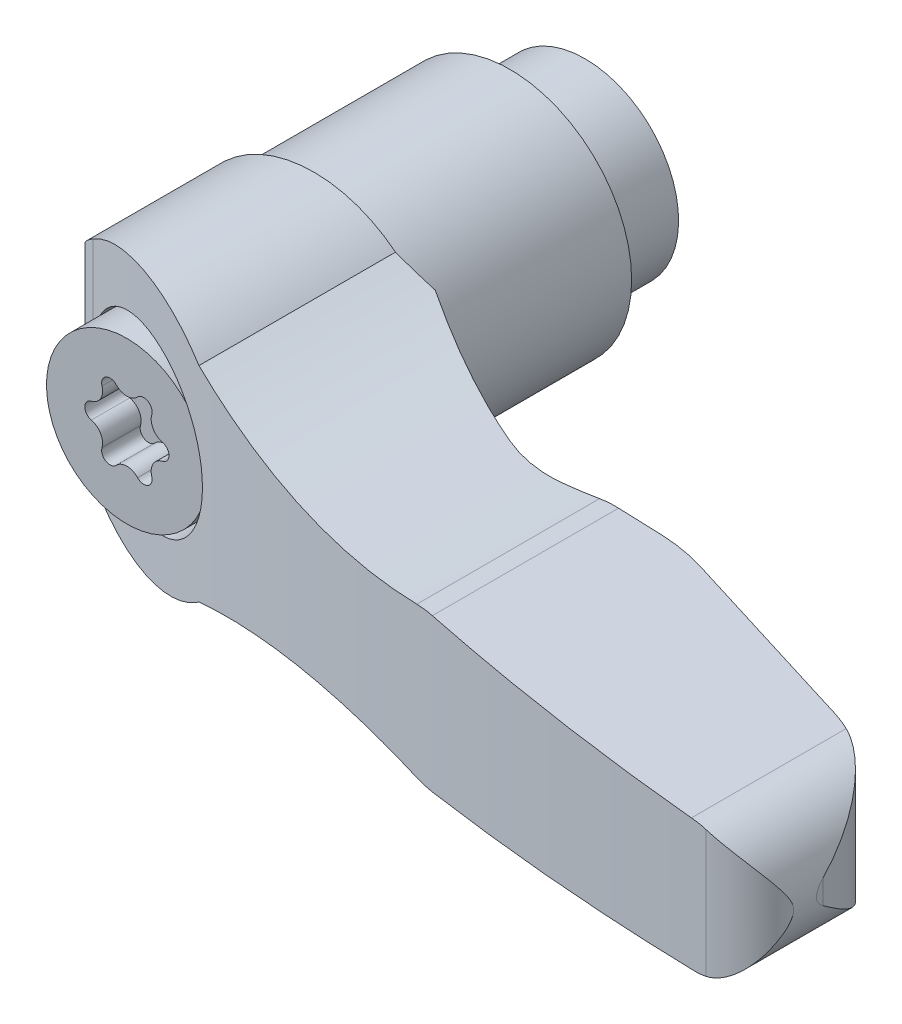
ISO-10303-21;
HEADER;
FILE_DESCRIPTION(('STEP AP214'),'2;1');
FILE_NAME('part.step','',(''),(''),'','','');
FILE_SCHEMA(('AUTOMOTIVE_DESIGN { 1 0 10303 214 1 1 1 1 }'));
ENDSEC;
DATA;
#1=APPLICATION_CONTEXT('core data for automotive mechanical design processes');
#2=APPLICATION_PROTOCOL_DEFINITION('international standard','automotive_design',2000,#1);
#3=PRODUCT_CONTEXT('',#1,'mechanical');
#4=PRODUCT('Part','Part','',(#3));
#5=PRODUCT_RELATED_PRODUCT_CATEGORY('part','',(#4));
#6=PRODUCT_DEFINITION_FORMATION('','',#4);
#7=PRODUCT_DEFINITION_CONTEXT('part definition',#1,'design');
#8=PRODUCT_DEFINITION('design','',#6,#7);
#9=PRODUCT_DEFINITION_SHAPE('','',#8);
#10=(LENGTH_UNIT() NAMED_UNIT(*) SI_UNIT(.MILLI.,.METRE.));
#11=(NAMED_UNIT(*) PLANE_ANGLE_UNIT() SI_UNIT($,.RADIAN.));
#12=(NAMED_UNIT(*) SI_UNIT($,.STERADIAN.) SOLID_ANGLE_UNIT());
#13=UNCERTAINTY_MEASURE_WITH_UNIT(LENGTH_MEASURE(1.E-05),#10,'distance_accuracy_value','');
#14=(GEOMETRIC_REPRESENTATION_CONTEXT(3) GLOBAL_UNCERTAINTY_ASSIGNED_CONTEXT((#13)) GLOBAL_UNIT_ASSIGNED_CONTEXT((#10,
#11,#12)) REPRESENTATION_CONTEXT('',''));
#15=CARTESIAN_POINT('',(0.,0.,0.));
#16=DIRECTION('',(0.,0.,1.));
#17=DIRECTION('',(1.,0.,0.));
#18=AXIS2_PLACEMENT_3D('',#15,#16,#17);
#19=CARTESIAN_POINT('',(0.9,1.55884572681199,26.56));
#20=DIRECTION('',(0.,0.,1.));
#21=DIRECTION('',(0.,-1.,0.));
#22=AXIS2_PLACEMENT_3D('',#19,#20,#21);
#23=CYLINDRICAL_SURFACE('',#22,0.45);
#24=DIRECTION('',(0.,0.,1.));
#25=VECTOR('',#24,1.);
#26=CARTESIAN_POINT('',(0.572727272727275,1.86770259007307,26.56));
#27=LINE('',#26,#25);
#28=CARTESIAN_POINT('',(0.572727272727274,1.86770259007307,22.44));
#29=VERTEX_POINT('',#28);
#30=CARTESIAN_POINT('',(0.572727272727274,1.86770259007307,24.5));
#31=VERTEX_POINT('',#30);
#32=EDGE_CURVE('E235',#29,#31,#27,.T.);
#33=ORIENTED_EDGE('',*,*,#32,.F.);
#34=CARTESIAN_POINT('',(0.9,1.55884572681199,22.44));
#35=DIRECTION('',(0.,0.,1.));
#36=DIRECTION('',(0.,-1.,0.));
#37=AXIS2_PLACEMENT_3D('',#34,#35,#36);
#38=CIRCLE('',#37,0.45);
#39=CARTESIAN_POINT('',(1.33111425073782,1.42984765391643,22.44));
#40=VERTEX_POINT('',#39);
#41=EDGE_CURVE('E228',#40,#29,#38,.T.);
#42=ORIENTED_EDGE('',*,*,#41,.F.);
#43=DIRECTION('',(0.,0.,1.));
#44=VECTOR('',#43,1.);
#45=CARTESIAN_POINT('',(1.33111424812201,1.42984764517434,26.56));
#46=LINE('',#45,#44);
#47=CARTESIAN_POINT('',(1.33111425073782,1.42984765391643,24.5));
#48=VERTEX_POINT('',#47);
#49=EDGE_CURVE('E232',#48,#40,#46,.F.);
#50=ORIENTED_EDGE('',*,*,#49,.F.);
#51=CARTESIAN_POINT('',(0.9,1.55884572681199,24.5));
#52=DIRECTION('',(0.,0.,1.));
#53=DIRECTION('',(0.,-1.,0.));
#54=AXIS2_PLACEMENT_3D('',#51,#52,#53);
#55=CIRCLE('',#54,0.45);
#56=EDGE_CURVE('E238',#31,#48,#55,.F.);
#57=ORIENTED_EDGE('',*,*,#56,.F.);
#58=EDGE_LOOP('',(#33,#42,#50,#57));
#59=FACE_BOUND('',#58,.T.);
#60=ADVANCED_FACE('F14',(#59),#23,.F.);
#61=CARTESIAN_POINT('',(0.,2.40820210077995,26.56));
#62=DIRECTION('',(0.,0.,1.));
#63=DIRECTION('',(0.,-1.,0.));
#64=AXIS2_PLACEMENT_3D('',#61,#62,#63);
#65=CYLINDRICAL_SURFACE('',#64,0.7875);
#66=CARTESIAN_POINT('',(0.,2.40820210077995,22.44));
#67=DIRECTION('',(0.,0.,1.));
#68=DIRECTION('',(0.,-1.,0.));
#69=AXIS2_PLACEMENT_3D('',#66,#67,#68);
#70=CIRCLE('',#69,0.7875);
#71=CARTESIAN_POINT('',(-0.572727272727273,1.86770259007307,22.44));
#72=VERTEX_POINT('',#71);
#73=EDGE_CURVE('E259',#72,#29,#70,.T.);
#74=ORIENTED_EDGE('',*,*,#73,.T.);
#75=ORIENTED_EDGE('',*,*,#32,.T.);
#76=CARTESIAN_POINT('',(0.,2.40820210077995,24.5));
#77=DIRECTION('',(0.,0.,1.));
#78=DIRECTION('',(0.,-1.,0.));
#79=AXIS2_PLACEMENT_3D('',#76,#77,#78);
#80=CIRCLE('',#79,0.7875);
#81=CARTESIAN_POINT('',(-0.572727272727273,1.86770259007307,24.5));
#82=VERTEX_POINT('',#81);
#83=EDGE_CURVE('E615',#31,#82,#80,.F.);
#84=ORIENTED_EDGE('',*,*,#83,.T.);
#85=DIRECTION('',(0.,0.,1.));
#86=VECTOR('',#85,1.);
#87=CARTESIAN_POINT('',(-0.572727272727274,1.86770259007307,26.56));
#88=LINE('',#87,#86);
#89=EDGE_CURVE('E249',#82,#72,#88,.F.);
#90=ORIENTED_EDGE('',*,*,#89,.T.);
#91=EDGE_LOOP('',(#74,#75,#84,#90));
#92=FACE_BOUND('',#91,.T.);
#93=ADVANCED_FACE('F670',(#92),#65,.T.);
#94=CARTESIAN_POINT('',(2.08556419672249,1.20410105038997,26.56));
#95=DIRECTION('',(0.,0.,1.));
#96=DIRECTION('',(0.,-1.,0.));
#97=AXIS2_PLACEMENT_3D('',#94,#95,#96);
#98=CYLINDRICAL_SURFACE('',#97,0.7875);
#99=CARTESIAN_POINT('',(2.08556419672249,1.20410105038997,22.44));
#100=DIRECTION('',(0.,0.,1.));
#101=DIRECTION('',(0.,-1.,0.));
#102=AXIS2_PLACEMENT_3D('',#99,#100,#101);
#103=CIRCLE('',#102,0.7875);
#104=CARTESIAN_POINT('',(1.90384152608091,0.437854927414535,22.44));
#105=VERTEX_POINT('',#104);
#106=EDGE_CURVE('E242',#40,#105,#103,.T.);
#107=ORIENTED_EDGE('',*,*,#106,.T.);
#108=DIRECTION('',(0.,0.,1.));
#109=VECTOR('',#108,1.);
#110=CARTESIAN_POINT('',(1.90384152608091,0.437854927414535,26.56));
#111=LINE('',#110,#109);
#112=CARTESIAN_POINT('',(1.90384152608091,0.437854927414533,24.5));
#113=VERTEX_POINT('',#112);
#114=EDGE_CURVE('E601',#105,#113,#111,.T.);
#115=ORIENTED_EDGE('',*,*,#114,.T.);
#116=CARTESIAN_POINT('',(2.08556419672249,1.20410105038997,24.5));
#117=DIRECTION('',(0.,0.,1.));
#118=DIRECTION('',(0.,-1.,0.));
#119=AXIS2_PLACEMENT_3D('',#116,#117,#118);
#120=CIRCLE('',#119,0.7875);
#121=EDGE_CURVE('E252',#113,#48,#120,.F.);
#122=ORIENTED_EDGE('',*,*,#121,.T.);
#123=ORIENTED_EDGE('',*,*,#49,.T.);
#124=EDGE_LOOP('',(#107,#115,#122,#123));
#125=FACE_BOUND('',#124,.T.);
#126=ADVANCED_FACE('F251',(#125),#98,.T.);
#127=CARTESIAN_POINT('',(-0.9,1.55884572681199,26.56));
#128=DIRECTION('',(0.,0.,1.));
#129=DIRECTION('',(0.,-1.,0.));
#130=AXIS2_PLACEMENT_3D('',#127,#128,#129);
#131=CYLINDRICAL_SURFACE('',#130,0.45);
#132=DIRECTION('',(0.,0.,1.));
#133=VECTOR('',#132,1.);
#134=CARTESIAN_POINT('',(-1.33111425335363,1.42984766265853,26.56));
#135=LINE('',#134,#133);
#136=CARTESIAN_POINT('',(-1.33111425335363,1.42984766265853,22.44));
#137=VERTEX_POINT('',#136);
#138=CARTESIAN_POINT('',(-1.33111425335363,1.42984766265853,24.5));
#139=VERTEX_POINT('',#138);
#140=EDGE_CURVE('E598',#137,#139,#135,.T.);
#141=ORIENTED_EDGE('',*,*,#140,.F.);
#142=CARTESIAN_POINT('',(-0.9,1.55884572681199,22.44));
#143=DIRECTION('',(0.,0.,1.));
#144=DIRECTION('',(0.,-1.,0.));
#145=AXIS2_PLACEMENT_3D('',#142,#143,#144);
#146=CIRCLE('',#145,0.45);
#147=EDGE_CURVE('E609',#72,#137,#146,.T.);
#148=ORIENTED_EDGE('',*,*,#147,.F.);
#149=ORIENTED_EDGE('',*,*,#89,.F.);
#150=CARTESIAN_POINT('',(-0.9,1.55884572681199,24.5));
#151=DIRECTION('',(0.,0.,1.));
#152=DIRECTION('',(0.,-1.,0.));
#153=AXIS2_PLACEMENT_3D('',#150,#151,#152);
#154=CIRCLE('',#153,0.45);
#155=EDGE_CURVE('E606',#139,#82,#154,.F.);
#156=ORIENTED_EDGE('',*,*,#155,.F.);
#157=EDGE_LOOP('',(#141,#148,#149,#156));
#158=FACE_BOUND('',#157,.T.);
#159=ADVANCED_FACE('F668',(#158),#131,.F.);
#160=CARTESIAN_POINT('',(1.8,0.,26.56));
#161=DIRECTION('',(0.,0.,1.));
#162=DIRECTION('',(0.,-1.,0.));
#163=AXIS2_PLACEMENT_3D('',#160,#161,#162);
#164=CYLINDRICAL_SURFACE('',#163,0.45);
#165=ORIENTED_EDGE('',*,*,#114,.F.);
#166=CARTESIAN_POINT('',(1.8,0.,22.44));
#167=DIRECTION('',(0.,0.,1.));
#168=DIRECTION('',(0.,-1.,0.));
#169=AXIS2_PLACEMENT_3D('',#166,#167,#168);
#170=CIRCLE('',#169,0.45);
#171=CARTESIAN_POINT('',(1.90384152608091,-0.437854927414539,22.44));
#172=VERTEX_POINT('',#171);
#173=EDGE_CURVE('E245',#172,#105,#170,.T.);
#174=ORIENTED_EDGE('',*,*,#173,.F.);
#175=DIRECTION('',(0.,0.,1.));
#176=VECTOR('',#175,1.);
#177=CARTESIAN_POINT('',(1.90384152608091,-0.437854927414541,26.56));
#178=LINE('',#177,#176);
#179=CARTESIAN_POINT('',(1.90384152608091,-0.437854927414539,24.5));
#180=VERTEX_POINT('',#179);
#181=EDGE_CURVE('E593',#180,#172,#178,.F.);
#182=ORIENTED_EDGE('',*,*,#181,.F.);
#183=CARTESIAN_POINT('',(1.8,0.,24.5));
#184=DIRECTION('',(0.,0.,1.));
#185=DIRECTION('',(0.,-1.,0.));
#186=AXIS2_PLACEMENT_3D('',#183,#184,#185);
#187=CIRCLE('',#186,0.45);
#188=EDGE_CURVE('E602',#113,#180,#187,.F.);
#189=ORIENTED_EDGE('',*,*,#188,.F.);
#190=EDGE_LOOP('',(#165,#174,#182,#189));
#191=FACE_BOUND('',#190,.T.);
#192=ADVANCED_FACE('F635',(#191),#164,.F.);
#193=CARTESIAN_POINT('',(4.,0.,0.));
#194=DIRECTION('',(0.,0.,-1.));
#195=DIRECTION('',(0.,1.,0.));
#196=AXIS2_PLACEMENT_3D('',#193,#194,#195);
#197=PLANE('',#196);
#198=CARTESIAN_POINT('',(0.,0.,0.));
#199=DIRECTION('',(0.,0.,-1.));
#200=DIRECTION('',(-1.,0.,0.));
#201=AXIS2_PLACEMENT_3D('',#198,#199,#200);
#202=CIRCLE('',#201,3.4499999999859);
#203=CARTESIAN_POINT('',(-3.4499999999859,0.,0.));
#204=VERTEX_POINT('',#203);
#205=EDGE_CURVE('E9',#204,#204,#202,.F.);
#206=ORIENTED_EDGE('',*,*,#205,.T.);
#207=EDGE_LOOP('',(#206));
#208=FACE_BOUND('',#207,.T.);
#209=CARTESIAN_POINT('',(0.,0.,0.));
#210=DIRECTION('',(0.,0.,-1.));
#211=DIRECTION('',(0.,1.,0.));
#212=AXIS2_PLACEMENT_3D('',#209,#210,#211);
#213=CIRCLE('',#212,5.);
#214=CARTESIAN_POINT('',(0.,5.,0.));
#215=VERTEX_POINT('',#214);
#216=EDGE_CURVE('E592',#215,#215,#213,.F.);
#217=ORIENTED_EDGE('',*,*,#216,.F.);
#218=EDGE_LOOP('',(#217));
#219=FACE_BOUND('',#218,.T.);
#220=ADVANCED_FACE('F631',(#208,#219),#197,.T.);
#221=CARTESIAN_POINT('',(-2.08556419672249,1.20410105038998,26.56));
#222=DIRECTION('',(0.,0.,1.));
#223=DIRECTION('',(0.,-1.,0.));
#224=AXIS2_PLACEMENT_3D('',#221,#222,#223);
#225=CYLINDRICAL_SURFACE('',#224,0.7875);
#226=CARTESIAN_POINT('',(-2.08556419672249,1.20410105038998,22.44));
#227=DIRECTION('',(0.,0.,1.));
#228=DIRECTION('',(0.,-1.,0.));
#229=AXIS2_PLACEMENT_3D('',#226,#227,#228);
#230=CIRCLE('',#229,0.7875);
#231=CARTESIAN_POINT('',(-1.90384151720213,0.437854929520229,22.44));
#232=VERTEX_POINT('',#231);
#233=EDGE_CURVE('E600',#232,#137,#230,.T.);
#234=ORIENTED_EDGE('',*,*,#233,.T.);
#235=ORIENTED_EDGE('',*,*,#140,.T.);
#236=CARTESIAN_POINT('',(-2.08556419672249,1.20410105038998,24.5));
#237=DIRECTION('',(0.,0.,1.));
#238=DIRECTION('',(0.,-1.,0.));
#239=AXIS2_PLACEMENT_3D('',#236,#237,#238);
#240=CIRCLE('',#239,0.7875);
#241=CARTESIAN_POINT('',(-1.90384151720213,0.437854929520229,24.5));
#242=VERTEX_POINT('',#241);
#243=EDGE_CURVE('E604',#139,#242,#240,.F.);
#244=ORIENTED_EDGE('',*,*,#243,.T.);
#245=DIRECTION('',(0.,0.,1.));
#246=VECTOR('',#245,1.);
#247=CARTESIAN_POINT('',(-1.90384150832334,0.437854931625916,26.56));
#248=LINE('',#247,#246);
#249=EDGE_CURVE('E588',#242,#232,#248,.F.);
#250=ORIENTED_EDGE('',*,*,#249,.T.);
#251=EDGE_LOOP('',(#234,#235,#244,#250));
#252=FACE_BOUND('',#251,.T.);
#253=ADVANCED_FACE('F634',(#252),#225,.T.);
#254=CARTESIAN_POINT('',(2.08556419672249,-1.20410105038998,26.56));
#255=DIRECTION('',(0.,0.,1.));
#256=DIRECTION('',(0.,-1.,0.));
#257=AXIS2_PLACEMENT_3D('',#254,#255,#256);
#258=CYLINDRICAL_SURFACE('',#257,0.7875);
#259=CARTESIAN_POINT('',(2.08556419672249,-1.20410105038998,22.44));
#260=DIRECTION('',(0.,0.,1.));
#261=DIRECTION('',(0.,-1.,0.));
#262=AXIS2_PLACEMENT_3D('',#259,#260,#261);
#263=CIRCLE('',#262,0.7875);
#264=CARTESIAN_POINT('',(1.33111425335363,-1.42984766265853,22.44));
#265=VERTEX_POINT('',#264);
#266=EDGE_CURVE('E596',#172,#265,#263,.T.);
#267=ORIENTED_EDGE('',*,*,#266,.T.);
#268=DIRECTION('',(0.,0.,1.));
#269=VECTOR('',#268,1.);
#270=CARTESIAN_POINT('',(1.33111425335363,-1.42984766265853,26.56));
#271=LINE('',#270,#269);
#272=CARTESIAN_POINT('',(1.33111425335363,-1.42984766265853,24.5));
#273=VERTEX_POINT('',#272);
#274=EDGE_CURVE('E575',#265,#273,#271,.T.);
#275=ORIENTED_EDGE('',*,*,#274,.T.);
#276=CARTESIAN_POINT('',(2.08556419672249,-1.20410105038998,24.5));
#277=DIRECTION('',(0.,0.,1.));
#278=DIRECTION('',(0.,-1.,0.));
#279=AXIS2_PLACEMENT_3D('',#276,#277,#278);
#280=CIRCLE('',#279,0.7875);
#281=EDGE_CURVE('E597',#273,#180,#280,.F.);
#282=ORIENTED_EDGE('',*,*,#281,.T.);
#283=ORIENTED_EDGE('',*,*,#181,.T.);
#284=EDGE_LOOP('',(#267,#275,#282,#283));
#285=FACE_BOUND('',#284,.T.);
#286=ADVANCED_FACE('F687',(#285),#258,.T.);
#287=CARTESIAN_POINT('',(0.,0.,6.4));
#288=DIRECTION('',(0.,0.,-1.));
#289=DIRECTION('',(0.,1.,0.));
#290=AXIS2_PLACEMENT_3D('',#287,#288,#289);
#291=CYLINDRICAL_SURFACE('',#290,5.);
#292=ORIENTED_EDGE('',*,*,#216,.T.);
#293=EDGE_LOOP('',(#292));
#294=FACE_BOUND('',#293,.T.);
#295=CARTESIAN_POINT('',(0.,0.,4.55000000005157));
#296=DIRECTION('',(0.,0.,-1.));
#297=DIRECTION('',(1.,0.,0.));
#298=AXIS2_PLACEMENT_3D('',#295,#296,#297);
#299=CIRCLE('',#298,4.99999999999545);
#300=CARTESIAN_POINT('',(4.99999999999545,0.,4.55000000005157));
#301=VERTEX_POINT('',#300);
#302=EDGE_CURVE('E585',#301,#301,#299,.T.);
#303=ORIENTED_EDGE('',*,*,#302,.T.);
#304=EDGE_LOOP('',(#303));
#305=FACE_BOUND('',#304,.T.);
#306=ADVANCED_FACE('F690',(#294,#305),#291,.T.);
#307=CARTESIAN_POINT('',(-1.8,0.,26.56));
#308=DIRECTION('',(0.,0.,1.));
#309=DIRECTION('',(0.,-1.,0.));
#310=AXIS2_PLACEMENT_3D('',#307,#308,#309);
#311=CYLINDRICAL_SURFACE('',#310,0.45);
#312=DIRECTION('',(0.,0.,1.));
#313=VECTOR('',#312,1.);
#314=CARTESIAN_POINT('',(-1.90384152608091,-0.437854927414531,26.56));
#315=LINE('',#314,#313);
#316=CARTESIAN_POINT('',(-1.90384152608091,-0.437854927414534,22.44));
#317=VERTEX_POINT('',#316);
#318=CARTESIAN_POINT('',(-1.9038415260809,-0.437854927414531,24.5));
#319=VERTEX_POINT('',#318);
#320=EDGE_CURVE('E580',#317,#319,#315,.T.);
#321=ORIENTED_EDGE('',*,*,#320,.F.);
#322=CARTESIAN_POINT('',(-1.8,0.,22.44));
#323=DIRECTION('',(0.,0.,1.));
#324=DIRECTION('',(0.,-1.,0.));
#325=AXIS2_PLACEMENT_3D('',#322,#323,#324);
#326=CIRCLE('',#325,0.45);
#327=EDGE_CURVE('E591',#232,#317,#326,.T.);
#328=ORIENTED_EDGE('',*,*,#327,.F.);
#329=ORIENTED_EDGE('',*,*,#249,.F.);
#330=CARTESIAN_POINT('',(-1.8,0.,24.5));
#331=DIRECTION('',(0.,0.,1.));
#332=DIRECTION('',(0.,-1.,0.));
#333=AXIS2_PLACEMENT_3D('',#330,#331,#332);
#334=CIRCLE('',#333,0.45);
#335=EDGE_CURVE('E579',#319,#242,#334,.F.);
#336=ORIENTED_EDGE('',*,*,#335,.F.);
#337=EDGE_LOOP('',(#321,#328,#329,#336));
#338=FACE_BOUND('',#337,.T.);
#339=ADVANCED_FACE('F660',(#338),#311,.F.);
#340=CARTESIAN_POINT('',(0.9,-1.55884572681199,26.56));
#341=DIRECTION('',(0.,0.,1.));
#342=DIRECTION('',(0.,-1.,0.));
#343=AXIS2_PLACEMENT_3D('',#340,#341,#342);
#344=CYLINDRICAL_SURFACE('',#343,0.45);
#345=ORIENTED_EDGE('',*,*,#274,.F.);
#346=CARTESIAN_POINT('',(0.9,-1.55884572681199,22.44));
#347=DIRECTION('',(0.,0.,1.));
#348=DIRECTION('',(0.,-1.,0.));
#349=AXIS2_PLACEMENT_3D('',#346,#347,#348);
#350=CIRCLE('',#349,0.45);
#351=CARTESIAN_POINT('',(0.572727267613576,-1.86770258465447,22.44));
#352=VERTEX_POINT('',#351);
#353=EDGE_CURVE('E760',#352,#265,#350,.T.);
#354=ORIENTED_EDGE('',*,*,#353,.F.);
#355=DIRECTION('',(0.,0.,1.));
#356=VECTOR('',#355,1.);
#357=CARTESIAN_POINT('',(0.572727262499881,-1.86770257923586,26.56));
#358=LINE('',#357,#356);
#359=CARTESIAN_POINT('',(0.572727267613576,-1.86770258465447,24.5));
#360=VERTEX_POINT('',#359);
#361=EDGE_CURVE('E571',#360,#352,#358,.F.);
#362=ORIENTED_EDGE('',*,*,#361,.F.);
#363=CARTESIAN_POINT('',(0.9,-1.55884572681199,24.5));
#364=DIRECTION('',(0.,0.,1.));
#365=DIRECTION('',(0.,-1.,0.));
#366=AXIS2_PLACEMENT_3D('',#363,#364,#365);
#367=CIRCLE('',#366,0.45);
#368=EDGE_CURVE('E578',#273,#360,#367,.F.);
#369=ORIENTED_EDGE('',*,*,#368,.F.);
#370=EDGE_LOOP('',(#345,#354,#362,#369));
#371=FACE_BOUND('',#370,.T.);
#372=ADVANCED_FACE('F696',(#371),#344,.F.);
#373=CARTESIAN_POINT('',(0.,0.,4.30000000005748));
#374=DIRECTION('',(0.,0.,-1.));
#375=DIRECTION('',(0.,1.,0.));
#376=AXIS2_PLACEMENT_3D('',#373,#374,#375);
#377=CONICAL_SURFACE('',#376,5.24999999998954,0.785398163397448);
#378=ORIENTED_EDGE('',*,*,#302,.F.);
#379=EDGE_LOOP('',(#378));
#380=FACE_BOUND('',#379,.T.);
#381=CARTESIAN_POINT('',(0.,0.,4.3));
#382=DIRECTION('',(0.,0.,-1.));
#383=DIRECTION('',(0.,1.,0.));
#384=AXIS2_PLACEMENT_3D('',#381,#382,#383);
#385=CIRCLE('',#384,5.25);
#386=CARTESIAN_POINT('',(0.,5.25,4.3));
#387=VERTEX_POINT('',#386);
#388=EDGE_CURVE('E567',#387,#387,#385,.T.);
#389=ORIENTED_EDGE('',*,*,#388,.T.);
#390=EDGE_LOOP('',(#389));
#391=FACE_BOUND('',#390,.T.);
#392=ADVANCED_FACE('F699',(#380,#391),#377,.F.);
#393=CARTESIAN_POINT('',(-2.08556419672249,-1.20410105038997,26.56));
#394=DIRECTION('',(0.,0.,1.));
#395=DIRECTION('',(0.,-1.,0.));
#396=AXIS2_PLACEMENT_3D('',#393,#394,#395);
#397=CYLINDRICAL_SURFACE('',#396,0.7875);
#398=CARTESIAN_POINT('',(-2.08556419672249,-1.20410105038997,22.44));
#399=DIRECTION('',(0.,0.,1.));
#400=DIRECTION('',(0.,-1.,0.));
#401=AXIS2_PLACEMENT_3D('',#398,#399,#400);
#402=CIRCLE('',#401,0.7875);
#403=CARTESIAN_POINT('',(-1.33111425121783,-1.42984765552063,22.44));
#404=VERTEX_POINT('',#403);
#405=EDGE_CURVE('E583',#317,#404,#402,.F.);
#406=ORIENTED_EDGE('',*,*,#405,.F.);
#407=ORIENTED_EDGE('',*,*,#320,.T.);
#408=CARTESIAN_POINT('',(-2.08556419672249,-1.20410105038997,24.5));
#409=DIRECTION('',(0.,0.,1.));
#410=DIRECTION('',(0.,-1.,0.));
#411=AXIS2_PLACEMENT_3D('',#408,#409,#410);
#412=CIRCLE('',#411,0.7875);
#413=CARTESIAN_POINT('',(-1.33111425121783,-1.42984765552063,24.5));
#414=VERTEX_POINT('',#413);
#415=EDGE_CURVE('E584',#319,#414,#412,.F.);
#416=ORIENTED_EDGE('',*,*,#415,.T.);
#417=DIRECTION('',(0.,0.,1.));
#418=VECTOR('',#417,1.);
#419=CARTESIAN_POINT('',(-1.33111424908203,-1.42984764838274,26.56));
#420=LINE('',#419,#418);
#421=EDGE_CURVE('E564',#414,#404,#420,.F.);
#422=ORIENTED_EDGE('',*,*,#421,.T.);
#423=EDGE_LOOP('',(#406,#407,#416,#422));
#424=FACE_BOUND('',#423,.T.);
#425=ADVANCED_FACE('F703',(#424),#397,.T.);
#426=CARTESIAN_POINT('',(0.,0.,22.44));
#427=DIRECTION('',(0.,0.,1.));
#428=DIRECTION('',(0.,-1.,0.));
#429=AXIS2_PLACEMENT_3D('',#426,#427,#428);
#430=PLANE('',#429);
#431=ORIENTED_EDGE('',*,*,#233,.F.);
#432=ORIENTED_EDGE('',*,*,#327,.T.);
#433=ORIENTED_EDGE('',*,*,#405,.T.);
#434=CARTESIAN_POINT('',(-0.9,-1.55884572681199,22.44));
#435=DIRECTION('',(0.,0.,1.));
#436=DIRECTION('',(0.,-1.,0.));
#437=AXIS2_PLACEMENT_3D('',#434,#435,#436);
#438=CIRCLE('',#437,0.45);
#439=CARTESIAN_POINT('',(-0.572727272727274,-1.86770259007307,22.44));
#440=VERTEX_POINT('',#439);
#441=EDGE_CURVE('E563',#404,#440,#438,.T.);
#442=ORIENTED_EDGE('',*,*,#441,.T.);
#443=CARTESIAN_POINT('',(0.,-2.40820210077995,22.44));
#444=DIRECTION('',(0.,0.,1.));
#445=DIRECTION('',(0.,-1.,0.));
#446=AXIS2_PLACEMENT_3D('',#443,#444,#445);
#447=CIRCLE('',#446,0.7875);
#448=EDGE_CURVE('E570',#352,#440,#447,.T.);
#449=ORIENTED_EDGE('',*,*,#448,.F.);
#450=ORIENTED_EDGE('',*,*,#353,.T.);
#451=ORIENTED_EDGE('',*,*,#266,.F.);
#452=ORIENTED_EDGE('',*,*,#173,.T.);
#453=ORIENTED_EDGE('',*,*,#106,.F.);
#454=ORIENTED_EDGE('',*,*,#41,.T.);
#455=ORIENTED_EDGE('',*,*,#73,.F.);
#456=ORIENTED_EDGE('',*,*,#147,.T.);
#457=EDGE_LOOP('',(#431,#432,#433,#442,#449,#450,#451,#452,#453,#454,#455,#456));
#458=FACE_BOUND('',#457,.T.);
#459=ADVANCED_FACE('F243',(#458),#430,.T.);
#460=CARTESIAN_POINT('',(0.,-2.40820210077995,26.56));
#461=DIRECTION('',(0.,0.,1.));
#462=DIRECTION('',(0.,-1.,0.));
#463=AXIS2_PLACEMENT_3D('',#460,#461,#462);
#464=CYLINDRICAL_SURFACE('',#463,0.7875);
#465=ORIENTED_EDGE('',*,*,#448,.T.);
#466=DIRECTION('',(0.,0.,1.));
#467=VECTOR('',#466,1.);
#468=CARTESIAN_POINT('',(-0.572727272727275,-1.86770259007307,26.56));
#469=LINE('',#468,#467);
#470=CARTESIAN_POINT('',(-0.572727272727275,-1.86770259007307,24.5));
#471=VERTEX_POINT('',#470);
#472=EDGE_CURVE('E559',#440,#471,#469,.T.);
#473=ORIENTED_EDGE('',*,*,#472,.T.);
#474=CARTESIAN_POINT('',(0.,-2.40820210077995,24.5));
#475=DIRECTION('',(0.,0.,1.));
#476=DIRECTION('',(0.,-1.,0.));
#477=AXIS2_PLACEMENT_3D('',#474,#475,#476);
#478=CIRCLE('',#477,0.7875);
#479=EDGE_CURVE('E574',#471,#360,#478,.F.);
#480=ORIENTED_EDGE('',*,*,#479,.T.);
#481=ORIENTED_EDGE('',*,*,#361,.T.);
#482=EDGE_LOOP('',(#465,#473,#480,#481));
#483=FACE_BOUND('',#482,.T.);
#484=ADVANCED_FACE('F710',(#483),#464,.T.);
#485=CARTESIAN_POINT('',(0.,0.,3.65));
#486=DIRECTION('',(0.,0.,-1.));
#487=DIRECTION('',(0.,1.,0.));
#488=AXIS2_PLACEMENT_3D('',#485,#486,#487);
#489=CYLINDRICAL_SURFACE('',#488,5.25);
#490=ORIENTED_EDGE('',*,*,#388,.F.);
#491=EDGE_LOOP('',(#490));
#492=FACE_BOUND('',#491,.T.);
#493=CARTESIAN_POINT('',(0.,0.,4.));
#494=DIRECTION('',(0.,0.,-1.));
#495=DIRECTION('',(0.,1.,0.));
#496=AXIS2_PLACEMENT_3D('',#493,#494,#495);
#497=CIRCLE('',#496,5.25);
#498=CARTESIAN_POINT('',(0.,5.25,4.));
#499=VERTEX_POINT('',#498);
#500=EDGE_CURVE('E562',#499,#499,#497,.F.);
#501=ORIENTED_EDGE('',*,*,#500,.F.);
#502=EDGE_LOOP('',(#501));
#503=FACE_BOUND('',#502,.T.);
#504=ADVANCED_FACE('F713',(#492,#503),#489,.F.);
#505=CARTESIAN_POINT('',(-6.36002265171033,-14.,4.));
#506=DIRECTION('',(0.707106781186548,0.,0.707106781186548));
#507=DIRECTION('',(-0.707106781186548,0.,0.707106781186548));
#508=AXIS2_PLACEMENT_3D('',#505,#506,#507);
#509=PLANE('',#508);
#510=DIRECTION('',(0.,1.,0.));
#511=VECTOR('',#510,1.);
#512=CARTESIAN_POINT('',(-6.36002265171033,0.,4.));
#513=LINE('',#512,#511);
#514=CARTESIAN_POINT('',(-6.36002265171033,-1.38824072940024,4.));
#515=VERTEX_POINT('',#514);
#516=CARTESIAN_POINT('',(-6.36002265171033,1.38824072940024,4.));
#517=VERTEX_POINT('',#516);
#518=EDGE_CURVE('E751',#515,#517,#513,.T.);
#519=ORIENTED_EDGE('',*,*,#518,.F.);
#520=CARTESIAN_POINT('',(-0.0100000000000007,0.,-2.35002265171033));
#521=DIRECTION('',(0.707106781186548,0.,0.707106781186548));
#522=DIRECTION('',(-0.707106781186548,0.,0.707106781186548));
#523=AXIS2_PLACEMENT_3D('',#520,#521,#522);
#524=ELLIPSE('',#523,9.19238815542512,6.5);
#525=EDGE_CURVE('E566',#517,#515,#524,.T.);
#526=ORIENTED_EDGE('',*,*,#525,.F.);
#527=EDGE_LOOP('',(#519,#526));
#528=FACE_BOUND('',#527,.T.);
#529=ADVANCED_FACE('F717',(#528),#509,.F.);
#530=CARTESIAN_POINT('',(-0.9,-1.55884572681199,26.56));
#531=DIRECTION('',(0.,0.,1.));
#532=DIRECTION('',(0.,-1.,0.));
#533=AXIS2_PLACEMENT_3D('',#530,#531,#532);
#534=CYLINDRICAL_SURFACE('',#533,0.45);
#535=ORIENTED_EDGE('',*,*,#472,.F.);
#536=ORIENTED_EDGE('',*,*,#441,.F.);
#537=ORIENTED_EDGE('',*,*,#421,.F.);
#538=CARTESIAN_POINT('',(-0.9,-1.55884572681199,24.5));
#539=DIRECTION('',(0.,0.,1.));
#540=DIRECTION('',(0.,-1.,0.));
#541=AXIS2_PLACEMENT_3D('',#538,#539,#540);
#542=CIRCLE('',#541,0.45);
#543=EDGE_CURVE('E749',#471,#414,#542,.F.);
#544=ORIENTED_EDGE('',*,*,#543,.F.);
#545=EDGE_LOOP('',(#535,#536,#537,#544));
#546=FACE_BOUND('',#545,.T.);
#547=ADVANCED_FACE('F721',(#546),#534,.F.);
#548=CARTESIAN_POINT('',(-3.26,0.,4.));
#549=DIRECTION('',(0.,0.,-1.));
#550=DIRECTION('',(0.,1.,0.));
#551=AXIS2_PLACEMENT_3D('',#548,#549,#550);
#552=PLANE('',#551);
#553=CARTESIAN_POINT('',(-0.00999999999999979,0.,4.));
#554=DIRECTION('',(0.,0.,1.));
#555=DIRECTION('',(-1.,0.,0.));
#556=AXIS2_PLACEMENT_3D('',#553,#554,#555);
#557=CIRCLE('',#556,6.5);
#558=EDGE_CURVE('E739',#515,#517,#557,.T.);
#559=ORIENTED_EDGE('',*,*,#558,.F.);
#560=ORIENTED_EDGE('',*,*,#518,.T.);
#561=EDGE_LOOP('',(#559,#560));
#562=FACE_BOUND('',#561,.T.);
#563=ORIENTED_EDGE('',*,*,#500,.T.);
#564=EDGE_LOOP('',(#563));
#565=FACE_BOUND('',#564,.T.);
#566=ADVANCED_FACE('F725',(#562,#565),#552,.T.);
#567=CARTESIAN_POINT('',(2.15,0.,24.5));
#568=DIRECTION('',(0.,0.,1.));
#569=DIRECTION('',(0.,-1.,0.));
#570=AXIS2_PLACEMENT_3D('',#567,#568,#569);
#571=PLANE('',#570);
#572=CARTESIAN_POINT('',(0.,0.,24.5));
#573=DIRECTION('',(0.,0.,-1.));
#574=DIRECTION('',(0.,1.,0.));
#575=AXIS2_PLACEMENT_3D('',#572,#573,#574);
#576=CIRCLE('',#575,4.3);
#577=CARTESIAN_POINT('',(0.,4.3,24.5));
#578=VERTEX_POINT('',#577);
#579=EDGE_CURVE('E737',#578,#578,#576,.T.);
#580=ORIENTED_EDGE('',*,*,#579,.F.);
#581=EDGE_LOOP('',(#580));
#582=FACE_BOUND('',#581,.T.);
#583=ORIENTED_EDGE('',*,*,#479,.F.);
#584=ORIENTED_EDGE('',*,*,#543,.T.);
#585=ORIENTED_EDGE('',*,*,#415,.F.);
#586=ORIENTED_EDGE('',*,*,#335,.T.);
#587=ORIENTED_EDGE('',*,*,#243,.F.);
#588=ORIENTED_EDGE('',*,*,#155,.T.);
#589=ORIENTED_EDGE('',*,*,#83,.F.);
#590=ORIENTED_EDGE('',*,*,#56,.T.);
#591=ORIENTED_EDGE('',*,*,#121,.F.);
#592=ORIENTED_EDGE('',*,*,#188,.T.);
#593=ORIENTED_EDGE('',*,*,#281,.F.);
#594=ORIENTED_EDGE('',*,*,#368,.T.);
#595=EDGE_LOOP('',(#583,#584,#585,#586,#587,#588,#589,#590,#591,#592,#593,#594));
#596=FACE_BOUND('',#595,.T.);
#597=ADVANCED_FACE('F656',(#582,#596),#571,.T.);
#598=CARTESIAN_POINT('',(39.9389658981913,-8.,27.2042491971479));
#599=DIRECTION('',(0.989626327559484,0.,-0.143665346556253));
#600=DIRECTION('',(0.143665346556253,0.,0.989626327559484));
#601=AXIS2_PLACEMENT_3D('',#598,#599,#600);
#602=PLANE('',#601);
#603=CARTESIAN_POINT('',(36.5,0.,3.51522972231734));
#604=DIRECTION('',(0.989626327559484,0.,-0.143665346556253));
#605=DIRECTION('',(0.143665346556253,0.,0.989626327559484));
#606=AXIS2_PLACEMENT_3D('',#603,#604,#605);
#607=ELLIPSE('',#606,24.3621728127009,3.5);
#608=CARTESIAN_POINT('',(39.9389658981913,-0.650779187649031,27.2042491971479));
#609=VERTEX_POINT('',#608);
#610=CARTESIAN_POINT('',(39.9389658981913,0.650779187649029,27.2042491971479));
#611=VERTEX_POINT('',#610);
#612=EDGE_CURVE('E463',#609,#611,#607,.F.);
#613=ORIENTED_EDGE('',*,*,#612,.F.);
#614=DIRECTION('',(0.,-1.,0.));
#615=VECTOR('',#614,1.);
#616=CARTESIAN_POINT('',(39.9389658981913,-8.,27.2042491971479));
#617=LINE('',#616,#615);
#618=EDGE_CURVE('E742',#611,#609,#617,.T.);
#619=ORIENTED_EDGE('',*,*,#618,.F.);
#620=EDGE_LOOP('',(#613,#619));
#621=FACE_BOUND('',#620,.T.);
#622=ADVANCED_FACE('F487',(#621),#602,.T.);
#623=CARTESIAN_POINT('',(33.8626602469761,-8.,28.0863544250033));
#624=DIRECTION('',(0.,-1.,0.));
#625=DIRECTION('',(1.,0.,0.));
#626=AXIS2_PLACEMENT_3D('',#623,#624,#625);
#627=CYLINDRICAL_SURFACE('',#626,6.14);
#628=ORIENTED_EDGE('',*,*,#618,.T.);
#629=CARTESIAN_POINT('',(36.5,-3.5,22.5416236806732));
#630=CARTESIAN_POINT('',(36.6061539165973,-3.50000941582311,22.5920863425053));
#631=CARTESIAN_POINT('',(36.7107657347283,-3.49517280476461,22.6456099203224));
#632=CARTESIAN_POINT('',(36.9160027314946,-3.47671082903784,22.758101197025));
#633=CARTESIAN_POINT('',(37.0166343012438,-3.46310021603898,22.8170596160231));
#634=CARTESIAN_POINT('',(37.2123479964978,-3.42816986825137,22.9392782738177));
#635=CARTESIAN_POINT('',(37.3074768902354,-3.40693163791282,23.002487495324));
#636=CARTESIAN_POINT('',(37.4929223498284,-3.3575759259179,23.13320682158));
#637=CARTESIAN_POINT('',(37.5832363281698,-3.32945478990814,23.2007191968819));
#638=CARTESIAN_POINT('',(37.7830795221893,-3.25850520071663,23.358740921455));
#639=CARTESIAN_POINT('',(37.8909927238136,-3.21376078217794,23.4504360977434));
#640=CARTESIAN_POINT('',(38.0982482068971,-3.11588681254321,23.6389903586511));
#641=CARTESIAN_POINT('',(38.1975840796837,-3.06275107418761,23.7358532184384));
#642=CARTESIAN_POINT('',(38.3880468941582,-2.94917464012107,23.9343090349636));
#643=CARTESIAN_POINT('',(38.4791322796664,-2.88870020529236,24.0359224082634));
#644=CARTESIAN_POINT('',(38.6526412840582,-2.76182607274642,24.2426721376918));
#645=CARTESIAN_POINT('',(38.7350674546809,-2.69542813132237,24.3478074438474));
#646=CARTESIAN_POINT('',(38.9229341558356,-2.52996933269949,24.6038856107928));
#647=CARTESIAN_POINT('',(39.0243159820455,-2.42850340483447,24.7562617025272));
#648=CARTESIAN_POINT('',(39.2111706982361,-2.21796613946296,25.0654781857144));
#649=CARTESIAN_POINT('',(39.2966363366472,-2.10889136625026,25.2223205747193));
#650=CARTESIAN_POINT('',(39.452222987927,-1.88493092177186,25.5392893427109));
#651=CARTESIAN_POINT('',(39.5223498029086,-1.77004746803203,25.699414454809));
#652=CARTESIAN_POINT('',(39.6478320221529,-1.53583460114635,26.0220530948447));
#653=CARTESIAN_POINT('',(39.7031929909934,-1.41650688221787,26.1845656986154));
#654=CARTESIAN_POINT('',(39.7933776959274,-1.1901857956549,26.4900634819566));
#655=CARTESIAN_POINT('',(39.8299343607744,-1.08360162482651,26.6328455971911));
#656=CARTESIAN_POINT('',(39.8923391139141,-0.86858691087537,26.918504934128));
#657=CARTESIAN_POINT('',(39.918226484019,-0.76016469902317,27.0613798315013));
#658=CARTESIAN_POINT('',(39.9389658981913,-0.650779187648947,27.204249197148));
#659=B_SPLINE_CURVE_WITH_KNOTS('',3,(#629,#630,#631,#632,#633,#634,#635,#636,#637,#638,#639,
#640,#641,#642,#643,#644,#645,#646,#647,#648,#649,#650,#651,#652,#653,#654,#655,#656,#657,#658),
.UNSPECIFIED.,.F.,.F.,(4,2,2,2,2,2,2,2,2,2,2,2,2,2,4),(0.,0.352350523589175,0.704110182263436,
1.05221781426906,1.40051067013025,1.84538152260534,2.29058194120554,2.73791274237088,
3.18511134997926,3.81198117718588,4.43913591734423,5.06605301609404,5.69273352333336,
6.23807905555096,6.78139842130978),.UNSPECIFIED.);
#660=CARTESIAN_POINT('',(36.5,-3.5,22.5416236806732));
#661=VERTEX_POINT('',#660);
#662=EDGE_CURVE('E467',#661,#609,#659,.T.);
#663=ORIENTED_EDGE('',*,*,#662,.F.);
#664=CARTESIAN_POINT('',(33.8626602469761,-3.59762871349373,28.0863544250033));
#665=DIRECTION('',(-0.0369925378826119,0.999315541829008,0.));
#666=DIRECTION('',(-0.999315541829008,-0.0369925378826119,0.));
#667=AXIS2_PLACEMENT_3D('',#664,#665,#666);
#668=ELLIPSE('',#667,6.14420545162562,6.14);
#669=CARTESIAN_POINT('',(35.5344609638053,-3.53574220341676,22.1783359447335));
#670=VERTEX_POINT('',#669);
#671=EDGE_CURVE('E747',#661,#670,#668,.T.);
#672=ORIENTED_EDGE('',*,*,#671,.T.);
#673=DIRECTION('',(0.,-1.,0.));
#674=VECTOR('',#673,1.);
#675=CARTESIAN_POINT('',(35.5344609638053,-8.,22.1783359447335));
#676=LINE('',#675,#674);
#677=CARTESIAN_POINT('',(35.5344609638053,3.53574220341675,22.1783359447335));
#678=VERTEX_POINT('',#677);
#679=EDGE_CURVE('E544',#678,#670,#676,.T.);
#680=ORIENTED_EDGE('',*,*,#679,.F.);
#681=CARTESIAN_POINT('',(33.8626602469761,3.59762871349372,28.0863544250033));
#682=DIRECTION('',(-0.036992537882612,-0.999315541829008,0.));
#683=DIRECTION('',(0.999315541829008,-0.036992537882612,0.));
#684=AXIS2_PLACEMENT_3D('',#681,#682,#683);
#685=ELLIPSE('',#684,6.14420545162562,6.14);
#686=CARTESIAN_POINT('',(36.5,3.5,22.5416236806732));
#687=VERTEX_POINT('',#686);
#688=EDGE_CURVE('E745',#678,#687,#685,.T.);
#689=ORIENTED_EDGE('',*,*,#688,.T.);
#690=CARTESIAN_POINT('',(39.9389658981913,0.65077918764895,27.204249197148));
#691=CARTESIAN_POINT('',(39.9247028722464,0.726086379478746,27.1059853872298));
#692=CARTESIAN_POINT('',(39.9079968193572,0.800887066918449,27.0076860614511));
#693=CARTESIAN_POINT('',(39.8696347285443,0.949458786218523,26.8112602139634));
#694=CARTESIAN_POINT('',(39.8479781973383,1.02322971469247,26.7131337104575));
#695=CARTESIAN_POINT('',(39.7995979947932,1.169880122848,26.5170899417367));
#696=CARTESIAN_POINT('',(39.7728626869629,1.24275713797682,26.4191736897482));
#697=CARTESIAN_POINT('',(39.7142815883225,1.38725410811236,26.2239599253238));
#698=CARTESIAN_POINT('',(39.6824358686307,1.4588740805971,26.1266624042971));
#699=CARTESIAN_POINT('',(39.5782917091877,1.67318502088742,25.8337016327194));
#700=CARTESIAN_POINT('',(39.4979263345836,1.81366367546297,25.6391889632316));
#701=CARTESIAN_POINT('',(39.3150854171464,2.08619457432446,25.2551202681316));
#702=CARTESIAN_POINT('',(39.2126344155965,2.218255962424,25.0655590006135));
#703=CARTESIAN_POINT('',(38.9595027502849,2.49877334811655,24.6523338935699));
#704=CARTESIAN_POINT('',(38.8031801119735,2.64456339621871,24.4302018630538));
#705=CARTESIAN_POINT('',(38.5417124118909,2.84488994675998,24.1082756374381));
#706=CARTESIAN_POINT('',(38.4501831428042,2.90854134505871,24.0029632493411));
#707=CARTESIAN_POINT('',(38.2579442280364,3.02861213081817,23.7967186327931));
#708=CARTESIAN_POINT('',(38.1572360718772,3.08503268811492,23.6957856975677));
#709=CARTESIAN_POINT('',(37.8892625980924,3.21757634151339,23.4457323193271));
#710=CARTESIAN_POINT('',(37.7155213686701,3.28779061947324,23.3001643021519));
#711=CARTESIAN_POINT('',(37.4396992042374,3.37286339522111,23.0946053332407));
#712=CARTESIAN_POINT('',(37.3453175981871,3.39783246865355,23.0282732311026));
#713=CARTESIAN_POINT('',(37.1517842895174,3.44019984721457,22.9003457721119));
#714=CARTESIAN_POINT('',(37.0526354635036,3.45760265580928,22.8387476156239));
#715=CARTESIAN_POINT('',(36.8781783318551,3.48029211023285,22.7372021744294));
#716=CARTESIAN_POINT('',(36.8038676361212,3.48759914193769,22.6959814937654));
#717=CARTESIAN_POINT('',(36.6533047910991,3.497455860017,22.6165121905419));
#718=CARTESIAN_POINT('',(36.5770513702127,3.50000234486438,22.5782655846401));
#719=CARTESIAN_POINT('',(36.5,3.5,22.5416236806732));
#720=B_SPLINE_CURVE_WITH_KNOTS('',3,(#690,#691,#692,#693,#694,#695,#696,#697,#698,#699,#700,
#701,#702,#703,#704,#705,#706,#707,#708,#709,#710,#711,#712,#713,#714,#715,#716,#717,#718,#719),
.UNSPECIFIED.,.F.,.F.,(4,2,2,2,2,2,2,2,2,2,2,2,2,2,4),(0.,0.373839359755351,0.747715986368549,
1.12245980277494,1.49719840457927,2.25512351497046,3.01221072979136,3.93367725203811,
4.39332639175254,4.85290107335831,5.56171222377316,5.91546495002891,6.26900683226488,
6.52468766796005,6.78054039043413),.UNSPECIFIED.);
#721=EDGE_CURVE('E436',#611,#687,#720,.T.);
#722=ORIENTED_EDGE('',*,*,#721,.F.);
#723=EDGE_LOOP('',(#628,#663,#672,#680,#689,#722));
#724=FACE_BOUND('',#723,.T.);
#725=ADVANCED_FACE('F481',(#724),#627,.T.);
#726=CARTESIAN_POINT('',(-0.0099999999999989,0.,10.28125));
#727=DIRECTION('',(0.,0.,1.));
#728=DIRECTION('',(-1.,0.,0.));
#729=AXIS2_PLACEMENT_3D('',#726,#727,#728);
#730=CYLINDRICAL_SURFACE('',#729,6.5);
#731=CARTESIAN_POINT('',(-0.00999999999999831,0.,14.5));
#732=DIRECTION('',(0.,0.,1.));
#733=DIRECTION('',(-1.,0.,0.));
#734=AXIS2_PLACEMENT_3D('',#731,#732,#733);
#735=CIRCLE('',#734,6.5);
#736=CARTESIAN_POINT('',(-6.51,0.,14.5));
#737=VERTEX_POINT('',#736);
#738=CARTESIAN_POINT('',(6.49,0.,14.5));
#739=VERTEX_POINT('',#738);
#740=EDGE_CURVE('E738',#737,#739,#735,.T.);
#741=ORIENTED_EDGE('',*,*,#740,.F.);
#742=CARTESIAN_POINT('',(-0.00999999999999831,0.,14.5));
#743=DIRECTION('',(0.,0.,1.));
#744=DIRECTION('',(-1.,0.,0.));
#745=AXIS2_PLACEMENT_3D('',#742,#743,#744);
#746=CIRCLE('',#745,6.5);
#747=EDGE_CURVE('E541',#739,#737,#746,.T.);
#748=ORIENTED_EDGE('',*,*,#747,.F.);
#749=EDGE_LOOP('',(#741,#748));
#750=FACE_BOUND('',#749,.T.);
#751=ORIENTED_EDGE('',*,*,#558,.T.);
#752=ORIENTED_EDGE('',*,*,#525,.T.);
#753=EDGE_LOOP('',(#751,#752));
#754=FACE_BOUND('',#753,.T.);
#755=ADVANCED_FACE('F486',(#750,#754),#730,.T.);
#756=CARTESIAN_POINT('',(0.,0.,22.9195));
#757=DIRECTION('',(0.,0.,-1.));
#758=DIRECTION('',(0.,1.,0.));
#759=AXIS2_PLACEMENT_3D('',#756,#757,#758);
#760=CYLINDRICAL_SURFACE('',#759,4.3);
#761=ORIENTED_EDGE('',*,*,#579,.T.);
#762=EDGE_LOOP('',(#761));
#763=FACE_BOUND('',#762,.T.);
#764=CARTESIAN_POINT('',(0.,0.,21.3400000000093));
#765=DIRECTION('',(0.,0.,1.));
#766=DIRECTION('',(1.,0.,0.));
#767=AXIS2_PLACEMENT_3D('',#764,#765,#766);
#768=CIRCLE('',#767,4.30000000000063);
#769=CARTESIAN_POINT('',(4.30000000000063,0.,21.3400000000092));
#770=VERTEX_POINT('',#769);
#771=EDGE_CURVE('E553',#770,#770,#768,.T.);
#772=ORIENTED_EDGE('',*,*,#771,.T.);
#773=EDGE_LOOP('',(#772));
#774=FACE_BOUND('',#773,.T.);
#775=ADVANCED_FACE('F493',(#763,#774),#760,.T.);
#776=CARTESIAN_POINT('',(-6.51,-8.,14.5));
#777=DIRECTION('',(0.,0.,-1.));
#778=DIRECTION('',(0.,1.,0.));
#779=AXIS2_PLACEMENT_3D('',#776,#777,#778);
#780=PLANE('',#779);
#781=ORIENTED_EDGE('',*,*,#740,.T.);
#782=DIRECTION('',(0.,-1.,0.));
#783=VECTOR('',#782,1.);
#784=CARTESIAN_POINT('',(6.49,-8.,14.5));
#785=LINE('',#784,#783);
#786=CARTESIAN_POINT('',(6.49,-4.77390244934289,14.5));
#787=VERTEX_POINT('',#786);
#788=EDGE_CURVE('E782',#739,#787,#785,.T.);
#789=ORIENTED_EDGE('',*,*,#788,.T.);
#790=CARTESIAN_POINT('',(14.8,-33.6,14.5));
#791=DIRECTION('',(0.,0.,1.));
#792=DIRECTION('',(0.,-1.,0.));
#793=AXIS2_PLACEMENT_3D('',#790,#791,#792);
#794=CIRCLE('',#793,30.);
#795=CARTESIAN_POINT('',(4.36278582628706,-5.47413005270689,14.5));
#796=VERTEX_POINT('',#795);
#797=EDGE_CURVE('E800',#787,#796,#794,.T.);
#798=ORIENTED_EDGE('',*,*,#797,.T.);
#799=CARTESIAN_POINT('',(0.,0.,14.5));
#800=DIRECTION('',(0.,0.,1.));
#801=DIRECTION('',(0.,-1.,0.));
#802=AXIS2_PLACEMENT_3D('',#799,#800,#801);
#803=CIRCLE('',#802,7.);
#804=CARTESIAN_POINT('',(-6.51,-2.57291663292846,14.5));
#805=VERTEX_POINT('',#804);
#806=EDGE_CURVE('E374',#805,#796,#803,.T.);
#807=ORIENTED_EDGE('',*,*,#806,.F.);
#808=DIRECTION('',(0.,-1.,0.));
#809=VECTOR('',#808,1.);
#810=CARTESIAN_POINT('',(-6.51,-8.,14.5));
#811=LINE('',#810,#809);
#812=EDGE_CURVE('E540',#737,#805,#811,.T.);
#813=ORIENTED_EDGE('',*,*,#812,.F.);
#814=EDGE_LOOP('',(#781,#789,#798,#807,#813));
#815=FACE_BOUND('',#814,.T.);
#816=ADVANCED_FACE('F496',(#815),#780,.T.);
#817=CARTESIAN_POINT('',(20.6060580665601,0.915064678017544,31.));
#818=DIRECTION('',(0.,0.,1.));
#819=DIRECTION('',(0.,-1.,0.));
#820=AXIS2_PLACEMENT_3D('',#817,#818,#819);
#821=CYLINDRICAL_SURFACE('',#820,5.);
#822=CARTESIAN_POINT('',(20.7910207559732,-4.08151303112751,28.9575923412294));
#823=CARTESIAN_POINT('',(20.6207575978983,-4.08776311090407,28.9275070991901));
#824=CARTESIAN_POINT('',(20.4510927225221,-4.08540030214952,28.8972050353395));
#825=CARTESIAN_POINT('',(20.1129595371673,-4.06344890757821,28.8361672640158));
#826=CARTESIAN_POINT('',(19.9444912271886,-4.04386032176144,28.8054315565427));
#827=CARTESIAN_POINT('',(19.7766211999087,-4.01565884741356,28.7744790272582));
#828=B_SPLINE_CURVE_WITH_KNOTS('',3,(#822,#823,#824,#825,#826,#827),.UNSPECIFIED.,.F.,.F.,(4,2,
4),(0.,0.517097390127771,1.03419478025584),.UNSPECIFIED.);
#829=CARTESIAN_POINT('',(20.7910207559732,-4.08151303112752,28.9575923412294));
#830=VERTEX_POINT('',#829);
#831=CARTESIAN_POINT('',(19.7766211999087,-4.01565884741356,28.7744790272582));
#832=VERTEX_POINT('',#831);
#833=EDGE_CURVE('E470',#830,#832,#828,.T.);
#834=ORIENTED_EDGE('',*,*,#833,.T.);
#835=DIRECTION('',(0.,0.,1.));
#836=VECTOR('',#835,1.);
#837=CARTESIAN_POINT('',(19.7766211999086,-4.01565884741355,31.));
#838=LINE('',#837,#836);
#839=CARTESIAN_POINT('',(19.7766211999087,-4.01565884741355,19.));
#840=VERTEX_POINT('',#839);
#841=EDGE_CURVE('E794',#832,#840,#838,.F.);
#842=ORIENTED_EDGE('',*,*,#841,.T.);
#843=CARTESIAN_POINT('',(20.6060580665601,0.915064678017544,19.));
#844=DIRECTION('',(0.,0.,1.));
#845=DIRECTION('',(0.,-1.,0.));
#846=AXIS2_PLACEMENT_3D('',#843,#844,#845);
#847=CIRCLE('',#846,5.);
#848=CARTESIAN_POINT('',(20.7910207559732,-4.08151303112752,19.));
#849=VERTEX_POINT('',#848);
#850=EDGE_CURVE('E786',#849,#840,#847,.F.);
#851=ORIENTED_EDGE('',*,*,#850,.F.);
#852=DIRECTION('',(0.,0.,1.));
#853=VECTOR('',#852,1.);
#854=CARTESIAN_POINT('',(20.7910207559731,-4.08151303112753,31.));
#855=LINE('',#854,#853);
#856=EDGE_CURVE('E809',#849,#830,#855,.T.);
#857=ORIENTED_EDGE('',*,*,#856,.T.);
#858=EDGE_LOOP('',(#834,#842,#851,#857));
#859=FACE_BOUND('',#858,.T.);
#860=ADVANCED_FACE('F428',(#859),#821,.T.);
#861=CARTESIAN_POINT('',(36.5,0.,31.));
#862=DIRECTION('',(0.,0.,1.));
#863=DIRECTION('',(0.,-1.,0.));
#864=AXIS2_PLACEMENT_3D('',#861,#862,#863);
#865=CYLINDRICAL_SURFACE('',#864,3.5);
#866=CARTESIAN_POINT('',(37.3240183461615,-3.40161634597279,30.8631619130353));
#867=CARTESIAN_POINT('',(37.188603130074,-3.43435641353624,30.8557619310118));
#868=CARTESIAN_POINT('',(37.0522273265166,-3.45892508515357,30.8481012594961));
#869=CARTESIAN_POINT('',(36.7775545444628,-3.49171963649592,30.8322585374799));
#870=CARTESIAN_POINT('',(36.6392575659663,-3.499945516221,30.8240764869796));
#871=CARTESIAN_POINT('',(36.5,-3.5,30.815633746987));
#872=B_SPLINE_CURVE_WITH_KNOTS('',3,(#866,#867,#868,#869,#870,#871),.UNSPECIFIED.,.F.,.F.,(4,2,
4),(0.,0.416348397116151,0.832696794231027),.UNSPECIFIED.);
#873=CARTESIAN_POINT('',(37.3240183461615,-3.40161634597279,30.8631619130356));
#874=VERTEX_POINT('',#873);
#875=CARTESIAN_POINT('',(36.5,-3.5,30.815633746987));
#876=VERTEX_POINT('',#875);
#877=EDGE_CURVE('E448',#874,#876,#872,.T.);
#878=ORIENTED_EDGE('',*,*,#877,.T.);
#879=DIRECTION('',(0.,0.,1.));
#880=VECTOR('',#879,1.);
#881=CARTESIAN_POINT('',(36.5,-3.5,31.));
#882=LINE('',#881,#880);
#883=EDGE_CURVE('E806',#876,#661,#882,.F.);
#884=ORIENTED_EDGE('',*,*,#883,.T.);
#885=ORIENTED_EDGE('',*,*,#662,.T.);
#886=ORIENTED_EDGE('',*,*,#612,.T.);
#887=ORIENTED_EDGE('',*,*,#721,.T.);
#888=DIRECTION('',(0.,0.,1.));
#889=VECTOR('',#888,1.);
#890=CARTESIAN_POINT('',(36.5,3.5,31.));
#891=LINE('',#890,#889);
#892=CARTESIAN_POINT('',(36.5,3.5,30.815633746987));
#893=VERTEX_POINT('',#892);
#894=EDGE_CURVE('E416',#687,#893,#891,.T.);
#895=ORIENTED_EDGE('',*,*,#894,.T.);
#896=CARTESIAN_POINT('',(36.5,3.5,30.815633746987));
#897=CARTESIAN_POINT('',(36.6392575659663,3.499945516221,30.8240764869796));
#898=CARTESIAN_POINT('',(36.7775545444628,3.49171963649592,30.8322585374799));
#899=CARTESIAN_POINT('',(37.0522273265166,3.45892508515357,30.8481012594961));
#900=CARTESIAN_POINT('',(37.188603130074,3.43435641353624,30.8557619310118));
#901=CARTESIAN_POINT('',(37.3240183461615,3.40161634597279,30.8631619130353));
#902=B_SPLINE_CURVE_WITH_KNOTS('',3,(#896,#897,#898,#899,#900,#901),.UNSPECIFIED.,.F.,.F.,(4,2,
4),(0.,0.416348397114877,0.832696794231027),.UNSPECIFIED.);
#903=CARTESIAN_POINT('',(37.3240183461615,3.40161634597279,30.8631619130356));
#904=VERTEX_POINT('',#903);
#905=EDGE_CURVE('E454',#893,#904,#902,.T.);
#906=ORIENTED_EDGE('',*,*,#905,.T.);
#907=CARTESIAN_POINT('',(37.3240183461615,-3.40161634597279,30.8631619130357));
#908=CARTESIAN_POINT('',(37.391971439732,-3.38517327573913,30.8668921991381));
#909=CARTESIAN_POINT('',(37.4595366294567,-3.36663320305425,30.8678982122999));
#910=CARTESIAN_POINT('',(37.5932555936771,-3.32560440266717,30.8647814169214));
#911=CARTESIAN_POINT('',(37.6594109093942,-3.30312026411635,30.8606645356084));
#912=CARTESIAN_POINT('',(37.7892420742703,-3.25463078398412,30.8476880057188));
#913=CARTESIAN_POINT('',(37.8529349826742,-3.22865926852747,30.8388717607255));
#914=CARTESIAN_POINT('',(37.9780608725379,-3.17332967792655,30.8169101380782));
#915=CARTESIAN_POINT('',(38.0394932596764,-3.14397072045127,30.8037636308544));
#916=CARTESIAN_POINT('',(38.2193405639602,-3.05154774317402,30.7585650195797));
#917=CARTESIAN_POINT('',(38.3339861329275,-2.98387991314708,30.7206782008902));
#918=CARTESIAN_POINT('',(38.5517467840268,-2.83858348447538,30.6324207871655));
#919=CARTESIAN_POINT('',(38.6548343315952,-2.76093200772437,30.5820212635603));
#920=CARTESIAN_POINT('',(38.8266237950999,-2.61655584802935,30.4842690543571));
#921=CARTESIAN_POINT('',(38.8977926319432,-2.55140368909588,30.4388637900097));
#922=CARTESIAN_POINT('',(39.0330318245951,-2.41719472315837,30.3433991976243));
#923=CARTESIAN_POINT('',(39.0970985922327,-2.34813596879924,30.2933375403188));
#924=CARTESIAN_POINT('',(39.2184581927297,-2.20651617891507,30.1893556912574));
#925=CARTESIAN_POINT('',(39.2757265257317,-2.13394372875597,30.1354226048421));
#926=CARTESIAN_POINT('',(39.3834200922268,-1.9860149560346,30.0247265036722));
#927=CARTESIAN_POINT('',(39.4338475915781,-1.91065956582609,29.9679644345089));
#928=CARTESIAN_POINT('',(39.542421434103,-1.73419420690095,29.8348143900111));
#929=CARTESIAN_POINT('',(39.598263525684,-1.63221056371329,29.7576996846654));
#930=CARTESIAN_POINT('',(39.699250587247,-1.42414609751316,29.601672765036));
#931=CARTESIAN_POINT('',(39.7443776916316,-1.31805876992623,29.5227577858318));
#932=CARTESIAN_POINT('',(39.8239747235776,-1.10201279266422,29.3659397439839));
#933=CARTESIAN_POINT('',(39.8584944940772,-0.992075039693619,29.2880336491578));
#934=CARTESIAN_POINT('',(39.9024720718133,-0.82253324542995,29.1754655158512));
#935=CARTESIAN_POINT('',(39.9158188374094,-0.765322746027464,29.13870216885));
#936=CARTESIAN_POINT('',(39.9398686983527,-0.648731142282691,29.0678855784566));
#937=CARTESIAN_POINT('',(39.9505741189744,-0.589352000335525,29.0338299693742));
#938=CARTESIAN_POINT('',(39.9677206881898,-0.477086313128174,28.9756719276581));
#939=CARTESIAN_POINT('',(39.974567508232,-0.424644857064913,28.9508463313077));
#940=CARTESIAN_POINT('',(39.9860225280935,-0.317100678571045,28.907341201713));
#941=CARTESIAN_POINT('',(39.9906385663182,-0.262008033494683,28.8886402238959));
#942=CARTESIAN_POINT('',(39.9966232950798,-0.160247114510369,28.8637621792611));
#943=CARTESIAN_POINT('',(39.9984523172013,-0.114054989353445,28.8558445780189));
#944=CARTESIAN_POINT('',(40.0002450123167,-0.0209847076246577,28.8480882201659));
#945=CARTESIAN_POINT('',(40.0002117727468,0.0258921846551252,28.8482360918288));
#946=CARTESIAN_POINT('',(39.9982952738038,0.118672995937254,28.8565205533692));
#947=CARTESIAN_POINT('',(39.9964185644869,0.164579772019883,28.8646288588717));
#948=CARTESIAN_POINT('',(39.9910078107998,0.254792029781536,28.8870889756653));
#949=CARTESIAN_POINT('',(39.9874686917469,0.299092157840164,28.9014598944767));
#950=CARTESIAN_POINT('',(39.9768286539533,0.407331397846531,28.9425912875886));
#951=CARTESIAN_POINT('',(39.9688318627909,0.470155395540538,28.9719647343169));
#952=CARTESIAN_POINT('',(39.9499914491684,0.592804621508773,29.0357410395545));
#953=CARTESIAN_POINT('',(39.9391403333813,0.652621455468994,29.0701570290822));
#954=CARTESIAN_POINT('',(39.9146680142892,0.770512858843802,29.1419527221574));
#955=CARTESIAN_POINT('',(39.9010255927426,0.828569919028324,29.1793537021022));
#956=CARTESIAN_POINT('',(39.8711029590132,0.942947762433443,29.2555520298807));
#957=CARTESIAN_POINT('',(39.8548256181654,0.999270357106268,29.2943478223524));
#958=CARTESIAN_POINT('',(39.8016739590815,1.1674299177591,29.4125134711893));
#959=CARTESIAN_POINT('',(39.7607265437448,1.27728939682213,29.4929030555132));
#960=CARTESIAN_POINT('',(39.6677865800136,1.49294867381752,29.6529500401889));
#961=CARTESIAN_POINT('',(39.6157834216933,1.59874445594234,29.7326066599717));
#962=CARTESIAN_POINT('',(39.5005966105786,1.80564912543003,29.8886982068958));
#963=CARTESIAN_POINT('',(39.4374685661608,1.90677830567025,29.9651469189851));
#964=CARTESIAN_POINT('',(39.2994325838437,2.10420227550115,30.1133265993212));
#965=CARTESIAN_POINT('',(39.2245348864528,2.20050117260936,30.1850615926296));
#966=CARTESIAN_POINT('',(39.0442952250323,2.40820732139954,30.3372677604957));
#967=CARTESIAN_POINT('',(38.9358891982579,2.51819093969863,30.4161164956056));
#968=CARTESIAN_POINT('',(38.7000552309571,2.72661786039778,30.559662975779));
#969=CARTESIAN_POINT('',(38.5726400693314,2.82506883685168,30.6243701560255));
#970=CARTESIAN_POINT('',(38.3254291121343,2.98922527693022,30.7237895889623));
#971=CARTESIAN_POINT('',(38.2087731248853,3.05759969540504,30.7618633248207));
#972=CARTESIAN_POINT('',(37.9650872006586,3.18151973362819,30.8217517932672));
#973=CARTESIAN_POINT('',(37.8380870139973,3.23710049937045,30.8436114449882));
#974=CARTESIAN_POINT('',(37.6449762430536,3.3080955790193,30.8616374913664));
#975=CARTESIAN_POINT('',(37.5816159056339,3.32934954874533,30.8652564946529));
#976=CARTESIAN_POINT('',(37.4536360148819,3.36824327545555,30.867801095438));
#977=CARTESIAN_POINT('',(37.389015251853,3.38587935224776,30.8667219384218));
#978=CARTESIAN_POINT('',(37.3240183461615,3.40161634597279,30.8631619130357));
#979=B_SPLINE_CURVE_WITH_KNOTS('',3,(#907,#908,#909,#910,#911,#912,#913,#914,#915,#916,#917,
#918,#919,#920,#921,#922,#923,#924,#925,#926,#927,#928,#929,#930,#931,#932,#933,#934,#935,#936,
#937,#938,#939,#940,#941,#942,#943,#944,#945,#946,#947,#948,#949,#950,#951,#952,#953,#954,#955,
#956,#957,#958,#959,#960,#961,#962,#963,#964,#965,#966,#967,#968,#969,#970,#971,#972,#973,#974,
#975,#976,#977,#978),.UNSPECIFIED.,.F.,.F.,(4,2,2,2,2,2,2,2,2,2,2,2,2,2,2,2,2,2,2,2,2,2,2,2,2,2,
2,2,2,2,2,2,2,2,2,4),(0.,0.20991378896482,0.419584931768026,0.62735226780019,0.83517384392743,
1.2486492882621,1.66308971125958,1.98257890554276,2.30222878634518,2.62299771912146,
2.94366014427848,3.36167065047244,3.78037330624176,4.19707731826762,4.40489951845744,
4.61253810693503,4.78756393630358,4.9619702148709,5.10204921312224,5.24189598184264,
5.38124764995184,5.52102749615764,5.72989301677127,5.9393124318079,6.15038720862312,
6.36123350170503,6.7871576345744,7.21349237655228,7.63775356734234,8.06164764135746,
8.58013018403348,9.09826573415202,9.51811060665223,9.9367879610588,10.1373304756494,
10.3380759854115),.UNSPECIFIED.);
#980=EDGE_CURVE('E408',#874,#904,#979,.T.);
#981=ORIENTED_EDGE('',*,*,#980,.F.);
#982=EDGE_LOOP('',(#878,#884,#885,#886,#887,#895,#906,#981));
#983=FACE_BOUND('',#982,.T.);
#984=ADVANCED_FACE('F422',(#983),#865,.T.);
#985=CARTESIAN_POINT('',(23.0466685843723,-8.,28.05));
#986=DIRECTION('',(0.,-1.,0.));
#987=DIRECTION('',(1.,0.,0.));
#988=AXIS2_PLACEMENT_3D('',#985,#986,#987);
#989=CYLINDRICAL_SURFACE('',#988,9.05000000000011);
#990=CARTESIAN_POINT('',(23.0466685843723,3.99801374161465,28.05));
#991=DIRECTION('',(-0.036992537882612,-0.999315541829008,0.));
#992=DIRECTION('',(0.999315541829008,-0.036992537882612,0.));
#993=AXIS2_PLACEMENT_3D('',#990,#991,#992);
#994=ELLIPSE('',#993,9.05619858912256,9.05000000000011);
#995=CARTESIAN_POINT('',(23.0466685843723,3.99801374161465,19.));
#996=VERTEX_POINT('',#995);
#997=CARTESIAN_POINT('',(25.5108048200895,3.90679665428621,19.34192715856));
#998=VERTEX_POINT('',#997);
#999=EDGE_CURVE('E404',#996,#998,#994,.T.);
#1000=ORIENTED_EDGE('',*,*,#999,.T.);
#1001=DIRECTION('',(0.,-1.,0.));
#1002=VECTOR('',#1001,1.);
#1003=CARTESIAN_POINT('',(25.5108048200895,-8.,19.34192715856));
#1004=LINE('',#1003,#1002);
#1005=CARTESIAN_POINT('',(25.5108048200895,-3.90679665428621,19.34192715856));
#1006=VERTEX_POINT('',#1005);
#1007=EDGE_CURVE('E461',#1006,#998,#1004,.F.);
#1008=ORIENTED_EDGE('',*,*,#1007,.F.);
#1009=CARTESIAN_POINT('',(23.0466685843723,-3.99801374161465,28.05));
#1010=DIRECTION('',(-0.0369925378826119,0.999315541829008,0.));
#1011=DIRECTION('',(-0.999315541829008,-0.0369925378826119,0.));
#1012=AXIS2_PLACEMENT_3D('',#1009,#1010,#1011);
#1013=ELLIPSE('',#1012,9.05619858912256,9.05000000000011);
#1014=CARTESIAN_POINT('',(23.0466685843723,-3.99801374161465,19.));
#1015=VERTEX_POINT('',#1014);
#1016=EDGE_CURVE('E418',#1006,#1015,#1013,.T.);
#1017=ORIENTED_EDGE('',*,*,#1016,.T.);
#1018=DIRECTION('',(0.,1.,0.));
#1019=VECTOR('',#1018,1.);
#1020=CARTESIAN_POINT('',(23.0466685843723,-8.,19.));
#1021=LINE('',#1020,#1019);
#1022=EDGE_CURVE('E548',#996,#1015,#1021,.F.);
#1023=ORIENTED_EDGE('',*,*,#1022,.F.);
#1024=EDGE_LOOP('',(#1000,#1008,#1017,#1023));
#1025=FACE_BOUND('',#1024,.T.);
#1026=ADVANCED_FACE('F427',(#1025),#989,.T.);
#1027=CARTESIAN_POINT('',(25.5108048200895,-8.,19.34192715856));
#1028=DIRECTION('',(0.272280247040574,0.,-0.962217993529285));
#1029=DIRECTION('',(0.962217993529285,0.,0.272280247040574));
#1030=AXIS2_PLACEMENT_3D('',#1027,#1028,#1029);
#1031=PLANE('',#1030);
#1032=DIRECTION('',(0.961608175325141,-0.0355966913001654,0.272107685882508));
#1033=VECTOR('',#1032,1.);
#1034=CARTESIAN_POINT('',(25.5108048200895,3.90679665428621,19.34192715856));
#1035=LINE('',#1034,#1033);
#1036=EDGE_CURVE('E406',#998,#678,#1035,.T.);
#1037=ORIENTED_EDGE('',*,*,#1036,.T.);
#1038=ORIENTED_EDGE('',*,*,#679,.T.);
#1039=DIRECTION('',(-0.961608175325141,-0.0355966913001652,-0.272107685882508));
#1040=VECTOR('',#1039,1.);
#1041=CARTESIAN_POINT('',(35.5344609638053,-3.53574220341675,22.1783359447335));
#1042=LINE('',#1041,#1040);
#1043=EDGE_CURVE('E803',#670,#1006,#1042,.T.);
#1044=ORIENTED_EDGE('',*,*,#1043,.T.);
#1045=ORIENTED_EDGE('',*,*,#1007,.T.);
#1046=EDGE_LOOP('',(#1037,#1038,#1044,#1045));
#1047=FACE_BOUND('',#1046,.T.);
#1048=ADVANCED_FACE('F846',(#1047),#1031,.T.);
#1049=CARTESIAN_POINT('',(20.60605806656,-0.915064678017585,31.));
#1050=DIRECTION('',(0.,0.,1.));
#1051=DIRECTION('',(0.,-1.,0.));
#1052=AXIS2_PLACEMENT_3D('',#1049,#1050,#1051);
#1053=CYLINDRICAL_SURFACE('',#1052,5.00000000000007);
#1054=CARTESIAN_POINT('',(19.7766211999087,4.01565884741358,28.7744790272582));
#1055=CARTESIAN_POINT('',(19.9444912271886,4.04386032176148,28.8054315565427));
#1056=CARTESIAN_POINT('',(20.1129595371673,4.06344890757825,28.8361672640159));
#1057=CARTESIAN_POINT('',(20.4510927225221,4.08540030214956,28.8972050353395));
#1058=CARTESIAN_POINT('',(20.6207575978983,4.08776311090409,28.9275070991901));
#1059=CARTESIAN_POINT('',(20.7910207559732,4.08151303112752,28.9575923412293));
#1060=B_SPLINE_CURVE_WITH_KNOTS('',3,(#1054,#1055,#1056,#1057,#1058,#1059),.UNSPECIFIED.,.F.,
.F.,(4,2,4),(0.,0.517097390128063,1.03419478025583),.UNSPECIFIED.);
#1061=CARTESIAN_POINT('',(19.7766211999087,4.01565884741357,28.7744790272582));
#1062=VERTEX_POINT('',#1061);
#1063=CARTESIAN_POINT('',(20.7910207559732,4.08151303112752,28.9575923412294));
#1064=VERTEX_POINT('',#1063);
#1065=EDGE_CURVE('E547',#1062,#1064,#1060,.T.);
#1066=ORIENTED_EDGE('',*,*,#1065,.T.);
#1067=DIRECTION('',(0.,0.,1.));
#1068=VECTOR('',#1067,1.);
#1069=CARTESIAN_POINT('',(20.7910207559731,4.08151303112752,31.));
#1070=LINE('',#1069,#1068);
#1071=CARTESIAN_POINT('',(20.7910207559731,4.08151303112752,19.));
#1072=VERTEX_POINT('',#1071);
#1073=EDGE_CURVE('E816',#1064,#1072,#1070,.F.);
#1074=ORIENTED_EDGE('',*,*,#1073,.T.);
#1075=CARTESIAN_POINT('',(20.60605806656,-0.915064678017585,19.));
#1076=DIRECTION('',(0.,0.,1.));
#1077=DIRECTION('',(0.,-1.,0.));
#1078=AXIS2_PLACEMENT_3D('',#1075,#1076,#1077);
#1079=CIRCLE('',#1078,5.00000000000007);
#1080=CARTESIAN_POINT('',(19.7766211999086,4.01565884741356,19.));
#1081=VERTEX_POINT('',#1080);
#1082=EDGE_CURVE('E552',#1081,#1072,#1079,.F.);
#1083=ORIENTED_EDGE('',*,*,#1082,.F.);
#1084=DIRECTION('',(0.,0.,1.));
#1085=VECTOR('',#1084,1.);
#1086=CARTESIAN_POINT('',(19.7766211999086,4.01565884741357,31.));
#1087=LINE('',#1086,#1085);
#1088=EDGE_CURVE('E403',#1081,#1062,#1087,.T.);
#1089=ORIENTED_EDGE('',*,*,#1088,.T.);
#1090=EDGE_LOOP('',(#1066,#1074,#1083,#1089));
#1091=FACE_BOUND('',#1090,.T.);
#1092=ADVANCED_FACE('F849',(#1091),#1053,.T.);
#1093=CARTESIAN_POINT('',(42.8289340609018,-8.,-49.9630271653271));
#1094=DIRECTION('',(0.,-1.,0.));
#1095=DIRECTION('',(1.,0.,0.));
#1096=AXIS2_PLACEMENT_3D('',#1093,#1094,#1095);
#1097=CYLINDRICAL_SURFACE('',#1096,74.0000000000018);
#1098=DIRECTION('',(0.,-1.,0.));
#1099=VECTOR('',#1098,1.);
#1100=CARTESIAN_POINT('',(14.2560355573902,-8.,18.2981585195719));
#1101=LINE('',#1100,#1099);
#1102=CARTESIAN_POINT('',(14.2560355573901,3.60493202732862,18.2981585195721));
#1103=VERTEX_POINT('',#1102);
#1104=CARTESIAN_POINT('',(14.2560355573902,-3.60493202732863,18.2981585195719));
#1105=VERTEX_POINT('',#1104);
#1106=EDGE_CURVE('E784',#1103,#1105,#1101,.T.);
#1107=ORIENTED_EDGE('',*,*,#1106,.T.);
#1108=CARTESIAN_POINT('',(14.2560355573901,-3.60493202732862,18.2981585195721));
#1109=CARTESIAN_POINT('',(13.91912090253,-3.61104217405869,18.1571345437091));
#1110=CARTESIAN_POINT('',(13.5833701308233,-3.62280963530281,18.0136612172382));
#1111=CARTESIAN_POINT('',(12.9145226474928,-3.65743626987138,17.7219861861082));
#1112=CARTESIAN_POINT('',(12.5814258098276,-3.68029491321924,17.5737847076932));
#1113=CARTESIAN_POINT('',(11.5893580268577,-3.7649360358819,17.1235938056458));
#1114=CARTESIAN_POINT('',(10.9347595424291,-3.84283944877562,16.8148240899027));
#1115=CARTESIAN_POINT('',(9.64003521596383,-4.03983028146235,16.1808788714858));
#1116=CARTESIAN_POINT('',(8.99990836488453,-4.15891482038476,15.8557045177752));
#1117=CARTESIAN_POINT('',(7.73340291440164,-4.43691869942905,15.1892512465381));
#1118=CARTESIAN_POINT('',(7.10709183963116,-4.5960001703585,14.8479114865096));
#1119=CARTESIAN_POINT('',(6.49,-4.77390244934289,14.5));
#1120=B_SPLINE_CURVE_WITH_KNOTS('',3,(#1108,#1109,#1110,#1111,#1112,#1113,#1114,#1115,#1116,
#1117,#1118,#1119),.UNSPECIFIED.,.F.,.F.,(4,2,2,2,2,4),(0.,1.09575278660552,2.19145321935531,
4.37360080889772,6.55559577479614,8.74658240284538),.UNSPECIFIED.);
#1121=EDGE_CURVE('E358',#1105,#787,#1120,.T.);
#1122=ORIENTED_EDGE('',*,*,#1121,.T.);
#1123=ORIENTED_EDGE('',*,*,#788,.F.);
#1124=DIRECTION('',(0.,1.,0.));
#1125=VECTOR('',#1124,1.);
#1126=CARTESIAN_POINT('',(6.49,-8.,14.5));
#1127=LINE('',#1126,#1125);
#1128=CARTESIAN_POINT('',(6.49,4.77390244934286,14.5));
#1129=VERTEX_POINT('',#1128);
#1130=EDGE_CURVE('E551',#1129,#739,#1127,.F.);
#1131=ORIENTED_EDGE('',*,*,#1130,.F.);
#1132=CARTESIAN_POINT('',(6.49,4.77390244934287,14.5));
#1133=CARTESIAN_POINT('',(7.10709183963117,4.59600017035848,14.8479114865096));
#1134=CARTESIAN_POINT('',(7.73340291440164,4.43691869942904,15.1892512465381));
#1135=CARTESIAN_POINT('',(8.99990836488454,4.15891482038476,15.8557045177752));
#1136=CARTESIAN_POINT('',(9.64003521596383,4.03983028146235,16.1808788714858));
#1137=CARTESIAN_POINT('',(10.9347595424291,3.84283944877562,16.8148240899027));
#1138=CARTESIAN_POINT('',(11.5893580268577,3.7649360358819,17.1235938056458));
#1139=CARTESIAN_POINT('',(12.5814258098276,3.68029491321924,17.5737847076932));
#1140=CARTESIAN_POINT('',(12.9145226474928,3.65743626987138,17.7219861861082));
#1141=CARTESIAN_POINT('',(13.5833701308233,3.62280963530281,18.0136612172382));
#1142=CARTESIAN_POINT('',(13.91912090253,3.61104217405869,18.1571345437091));
#1143=CARTESIAN_POINT('',(14.2560355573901,3.60493202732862,18.2981585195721));
#1144=B_SPLINE_CURVE_WITH_KNOTS('',3,(#1132,#1133,#1134,#1135,#1136,#1137,#1138,#1139,#1140,
#1141,#1142,#1143),.UNSPECIFIED.,.F.,.F.,(4,2,2,2,2,4),(0.,2.19098662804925,4.37298159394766,
6.55512918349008,7.65082961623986,8.74658240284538),.UNSPECIFIED.);
#1145=EDGE_CURVE('E394',#1129,#1103,#1144,.T.);
#1146=ORIENTED_EDGE('',*,*,#1145,.T.);
#1147=EDGE_LOOP('',(#1107,#1122,#1123,#1131,#1146));
#1148=FACE_BOUND('',#1147,.T.);
#1149=ADVANCED_FACE('F381',(#1148),#1097,.F.);
#1150=CARTESIAN_POINT('',(17.7504238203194,-8.,9.95000000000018));
#1151=DIRECTION('',(0.,-1.,0.));
#1152=DIRECTION('',(1.,0.,0.));
#1153=AXIS2_PLACEMENT_3D('',#1150,#1151,#1152);
#1154=CYLINDRICAL_SURFACE('',#1153,9.04999999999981);
#1155=ORIENTED_EDGE('',*,*,#1106,.F.);
#1156=CARTESIAN_POINT('',(14.2560355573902,3.60493202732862,18.2981585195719));
#1157=CARTESIAN_POINT('',(14.483816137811,3.60077563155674,18.3935396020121));
#1158=CARTESIAN_POINT('',(14.7155749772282,3.59919241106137,18.4795580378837));
#1159=CARTESIAN_POINT('',(15.1854578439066,3.60156277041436,18.6324166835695));
#1160=CARTESIAN_POINT('',(15.4235855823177,3.60551965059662,18.699245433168));
#1161=CARTESIAN_POINT('',(15.9002362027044,3.61924836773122,18.8121846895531));
#1162=CARTESIAN_POINT('',(16.1386829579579,3.62891979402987,18.8586293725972));
#1163=CARTESIAN_POINT('',(16.6180975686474,3.65418161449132,18.9321530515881));
#1164=CARTESIAN_POINT('',(16.8590635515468,3.66976787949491,18.9592455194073));
#1165=CARTESIAN_POINT('',(17.2084780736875,3.69663888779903,18.9844088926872));
#1166=CARTESIAN_POINT('',(17.3166030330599,3.70554405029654,18.9902441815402));
#1167=CARTESIAN_POINT('',(17.5333084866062,3.72457700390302,18.9980471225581));
#1168=CARTESIAN_POINT('',(17.641889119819,3.73470940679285,18.9999996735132));
#1169=CARTESIAN_POINT('',(17.7504238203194,3.74543587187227,19.));
#1170=B_SPLINE_CURVE_WITH_KNOTS('',3,(#1156,#1157,#1158,#1159,#1160,#1161,#1162,#1163,#1164,
#1165,#1166,#1167,#1168,#1169),.UNSPECIFIED.,.F.,.F.,(4,2,2,2,2,2,4),(0.,0.740736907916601,
1.48191527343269,2.2104421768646,2.93846142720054,3.26434207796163,3.59148772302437),.UNSPECIFIED.);
#1171=CARTESIAN_POINT('',(17.7504238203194,3.74543587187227,19.));
#1172=VERTEX_POINT('',#1171);
#1173=EDGE_CURVE('E387',#1103,#1172,#1170,.T.);
#1174=ORIENTED_EDGE('',*,*,#1173,.T.);
#1175=DIRECTION('',(0.,1.,0.));
#1176=VECTOR('',#1175,1.);
#1177=CARTESIAN_POINT('',(17.7504238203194,-8.,19.));
#1178=LINE('',#1177,#1176);
#1179=CARTESIAN_POINT('',(17.7504238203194,-3.74543587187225,19.));
#1180=VERTEX_POINT('',#1179);
#1181=EDGE_CURVE('E787',#1180,#1172,#1178,.T.);
#1182=ORIENTED_EDGE('',*,*,#1181,.F.);
#1183=CARTESIAN_POINT('',(17.7504238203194,-3.74543587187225,19.));
#1184=CARTESIAN_POINT('',(17.5046390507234,-3.72111558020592,19.0000347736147));
#1185=CARTESIAN_POINT('',(17.2585407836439,-3.69988852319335,18.9899888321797));
#1186=CARTESIAN_POINT('',(16.7673975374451,-3.66357523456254,18.9498183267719));
#1187=CARTESIAN_POINT('',(16.5223532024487,-3.64849234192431,18.9196828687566));
#1188=CARTESIAN_POINT('',(16.039413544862,-3.6246526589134,18.8400993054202));
#1189=CARTESIAN_POINT('',(15.8014675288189,-3.61579257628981,18.7909886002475));
#1190=CARTESIAN_POINT('',(15.3302904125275,-3.60376296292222,18.6737788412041));
#1191=CARTESIAN_POINT('',(15.0970562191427,-3.60058957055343,18.605692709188));
#1192=CARTESIAN_POINT('',(14.7640124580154,-3.59984438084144,18.4937500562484));
#1193=CARTESIAN_POINT('',(14.6616681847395,-3.60014663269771,18.4572847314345));
#1194=CARTESIAN_POINT('',(14.4579719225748,-3.60177627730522,18.3805483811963));
#1195=CARTESIAN_POINT('',(14.3566253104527,-3.60310763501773,18.3402631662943));
#1196=CARTESIAN_POINT('',(14.2560355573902,-3.60493202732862,18.2981585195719));
#1197=B_SPLINE_CURVE_WITH_KNOTS('',3,(#1183,#1184,#1185,#1186,#1187,#1188,#1189,#1190,#1191,
#1192,#1193,#1194,#1195,#1196),.UNSPECIFIED.,.F.,.F.,(4,2,2,2,2,2,4),(0.,0.740745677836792,
1.48189337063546,2.21042785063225,2.93846742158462,3.26434594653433,3.59148632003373),.UNSPECIFIED.);
#1198=EDGE_CURVE('E366',#1180,#1105,#1197,.T.);
#1199=ORIENTED_EDGE('',*,*,#1198,.T.);
#1200=EDGE_LOOP('',(#1155,#1174,#1182,#1199));
#1201=FACE_BOUND('',#1200,.T.);
#1202=ADVANCED_FACE('F376',(#1201),#1154,.F.);
#1203=CARTESIAN_POINT('',(17.7504238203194,-8.,19.));
#1204=DIRECTION('',(0.,0.,-1.));
#1205=DIRECTION('',(0.,1.,0.));
#1206=AXIS2_PLACEMENT_3D('',#1203,#1204,#1205);
#1207=PLANE('',#1206);
#1208=DIRECTION('',(0.999315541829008,-0.036992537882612,0.));
#1209=VECTOR('',#1208,1.);
#1210=CARTESIAN_POINT('',(20.7910207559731,4.08151303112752,19.));
#1211=LINE('',#1210,#1209);
#1212=EDGE_CURVE('E407',#1072,#996,#1211,.T.);
#1213=ORIENTED_EDGE('',*,*,#1212,.T.);
#1214=ORIENTED_EDGE('',*,*,#1022,.T.);
#1215=DIRECTION('',(-0.999315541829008,-0.0369925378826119,0.));
#1216=VECTOR('',#1215,1.);
#1217=CARTESIAN_POINT('',(36.5,-3.5,19.));
#1218=LINE('',#1217,#1216);
#1219=EDGE_CURVE('E417',#1015,#849,#1218,.T.);
#1220=ORIENTED_EDGE('',*,*,#1219,.T.);
#1221=ORIENTED_EDGE('',*,*,#850,.T.);
#1222=CARTESIAN_POINT('',(14.8,-33.6,19.));
#1223=DIRECTION('',(0.,0.,1.));
#1224=DIRECTION('',(0.,-1.,0.));
#1225=AXIS2_PLACEMENT_3D('',#1222,#1223,#1224);
#1226=CIRCLE('',#1225,30.);
#1227=EDGE_CURVE('E796',#840,#1180,#1226,.T.);
#1228=ORIENTED_EDGE('',*,*,#1227,.T.);
#1229=ORIENTED_EDGE('',*,*,#1181,.T.);
#1230=CARTESIAN_POINT('',(14.8,33.6,19.));
#1231=DIRECTION('',(0.,0.,1.));
#1232=DIRECTION('',(0.,-1.,0.));
#1233=AXIS2_PLACEMENT_3D('',#1230,#1231,#1232);
#1234=CIRCLE('',#1233,30.);
#1235=EDGE_CURVE('E393',#1172,#1081,#1234,.T.);
#1236=ORIENTED_EDGE('',*,*,#1235,.T.);
#1237=ORIENTED_EDGE('',*,*,#1082,.T.);
#1238=EDGE_LOOP('',(#1213,#1214,#1220,#1221,#1228,#1229,#1236,#1237));
#1239=FACE_BOUND('',#1238,.T.);
#1240=ADVANCED_FACE('F380',(#1239),#1207,.T.);
#1241=CARTESIAN_POINT('',(-6.51,-8.,14.5));
#1242=DIRECTION('',(0.,0.,-1.));
#1243=DIRECTION('',(0.,1.,0.));
#1244=AXIS2_PLACEMENT_3D('',#1241,#1242,#1243);
#1245=PLANE('',#1244);
#1246=DIRECTION('',(0.,-1.,0.));
#1247=VECTOR('',#1246,1.);
#1248=CARTESIAN_POINT('',(-6.51,-8.,14.5));
#1249=LINE('',#1248,#1247);
#1250=CARTESIAN_POINT('',(-6.51,2.57291663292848,14.5));
#1251=VERTEX_POINT('',#1250);
#1252=EDGE_CURVE('E537',#1251,#737,#1249,.T.);
#1253=ORIENTED_EDGE('',*,*,#1252,.F.);
#1254=CARTESIAN_POINT('',(0.,0.,14.5));
#1255=DIRECTION('',(0.,0.,1.));
#1256=DIRECTION('',(0.,-1.,0.));
#1257=AXIS2_PLACEMENT_3D('',#1254,#1255,#1256);
#1258=CIRCLE('',#1257,7.);
#1259=CARTESIAN_POINT('',(4.36278582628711,5.47413005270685,14.5));
#1260=VERTEX_POINT('',#1259);
#1261=EDGE_CURVE('E312',#1260,#1251,#1258,.T.);
#1262=ORIENTED_EDGE('',*,*,#1261,.F.);
#1263=CARTESIAN_POINT('',(14.8,33.6,14.5));
#1264=DIRECTION('',(0.,0.,1.));
#1265=DIRECTION('',(0.,-1.,0.));
#1266=AXIS2_PLACEMENT_3D('',#1263,#1264,#1265);
#1267=CIRCLE('',#1266,30.);
#1268=EDGE_CURVE('E400',#1260,#1129,#1267,.T.);
#1269=ORIENTED_EDGE('',*,*,#1268,.T.);
#1270=ORIENTED_EDGE('',*,*,#1130,.T.);
#1271=ORIENTED_EDGE('',*,*,#747,.T.);
#1272=EDGE_LOOP('',(#1253,#1262,#1269,#1270,#1271));
#1273=FACE_BOUND('',#1272,.T.);
#1274=ADVANCED_FACE('F866',(#1273),#1245,.T.);
#1275=CARTESIAN_POINT('',(-6.51,-8.,18.7873257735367));
#1276=DIRECTION('',(-1.,0.,0.));
#1277=DIRECTION('',(0.,-1.,0.));
#1278=AXIS2_PLACEMENT_3D('',#1275,#1276,#1277);
#1279=PLANE('',#1278);
#1280=ORIENTED_EDGE('',*,*,#1252,.T.);
#1281=ORIENTED_EDGE('',*,*,#812,.T.);
#1282=DIRECTION('',(0.,0.,1.));
#1283=VECTOR('',#1282,1.);
#1284=CARTESIAN_POINT('',(-6.51,-2.57291663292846,31.));
#1285=LINE('',#1284,#1283);
#1286=CARTESIAN_POINT('',(-6.51,-2.57291663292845,18.7873257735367));
#1287=VERTEX_POINT('',#1286);
#1288=EDGE_CURVE('E556',#1287,#805,#1285,.F.);
#1289=ORIENTED_EDGE('',*,*,#1288,.F.);
#1290=DIRECTION('',(0.,-1.,0.));
#1291=VECTOR('',#1290,1.);
#1292=CARTESIAN_POINT('',(-6.51,-8.,18.7873257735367));
#1293=LINE('',#1292,#1291);
#1294=CARTESIAN_POINT('',(-6.51,2.57291663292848,18.7873257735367));
#1295=VERTEX_POINT('',#1294);
#1296=EDGE_CURVE('E295',#1295,#1287,#1293,.T.);
#1297=ORIENTED_EDGE('',*,*,#1296,.F.);
#1298=DIRECTION('',(0.,0.,1.));
#1299=VECTOR('',#1298,1.);
#1300=CARTESIAN_POINT('',(-6.51,2.57291663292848,31.));
#1301=LINE('',#1300,#1299);
#1302=EDGE_CURVE('E522',#1251,#1295,#1301,.T.);
#1303=ORIENTED_EDGE('',*,*,#1302,.F.);
#1304=EDGE_LOOP('',(#1280,#1281,#1289,#1297,#1303));
#1305=FACE_BOUND('',#1304,.T.);
#1306=ADVANCED_FACE('F319',(#1305),#1279,.T.);
#1307=CARTESIAN_POINT('',(0.,0.,25.1119377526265));
#1308=DIRECTION('',(0.,0.,1.));
#1309=DIRECTION('',(0.,-1.,0.));
#1310=AXIS2_PLACEMENT_3D('',#1307,#1308,#1309);
#1311=CONICAL_SURFACE('',#1310,4.63000179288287,0.087266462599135);
#1312=ORIENTED_EDGE('',*,*,#771,.F.);
#1313=EDGE_LOOP('',(#1312));
#1314=FACE_BOUND('',#1313,.T.);
#1315=CARTESIAN_POINT('',(-4.25177912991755,-0.978667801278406,22.0596314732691));
#1316=CARTESIAN_POINT('',(-4.26972622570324,-0.898052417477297,22.0528107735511));
#1317=CARTESIAN_POINT('',(-4.28545076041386,-0.816879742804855,22.0466842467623));
#1318=CARTESIAN_POINT('',(-4.31241424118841,-0.653684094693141,22.0360094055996));
#1319=CARTESIAN_POINT('',(-4.32365284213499,-0.571661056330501,22.0314612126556));
#1320=CARTESIAN_POINT('',(-4.34147880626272,-0.408164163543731,22.0241839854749));
#1321=CARTESIAN_POINT('',(-4.34812752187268,-0.326698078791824,22.0214309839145));
#1322=CARTESIAN_POINT('',(-4.35699496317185,-0.163487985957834,22.0177481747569));
#1323=CARTESIAN_POINT('',(-4.35921392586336,-0.0817439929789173,22.0168182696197));
#1324=CARTESIAN_POINT('',(-4.35921392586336,0.0817439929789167,22.0168182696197));
#1325=CARTESIAN_POINT('',(-4.35699496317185,0.163487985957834,22.0177481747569));
#1326=CARTESIAN_POINT('',(-4.34812752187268,0.326698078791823,22.0214309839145));
#1327=CARTESIAN_POINT('',(-4.34147880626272,0.40816416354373,22.0241839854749));
#1328=CARTESIAN_POINT('',(-4.32365284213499,0.5716610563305,22.0314612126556));
#1329=CARTESIAN_POINT('',(-4.31241424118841,0.65368409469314,22.0360094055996));
#1330=CARTESIAN_POINT('',(-4.28545076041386,0.816879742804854,22.0466842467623));
#1331=CARTESIAN_POINT('',(-4.26972622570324,0.898052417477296,22.0528107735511));
#1332=CARTESIAN_POINT('',(-4.25177912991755,0.978667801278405,22.0596314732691));
#1333=B_SPLINE_CURVE_WITH_KNOTS('',3,(#1315,#1316,#1317,#1318,#1319,#1320,#1321,#1322,#1323,
#1324,#1325,#1326,#1327,#1328,#1329,#1330,#1331,#1332),.UNSPECIFIED.,.F.,.F.,(4,2,2,2,2,2,2,2,
4),(0.,0.248581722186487,0.497182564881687,0.742392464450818,0.987589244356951,1.23278602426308,
1.47799592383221,1.72659676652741,1.9751784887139),.UNSPECIFIED.);
#1334=CARTESIAN_POINT('',(-4.25177912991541,-0.978667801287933,22.0596314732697));
#1335=VERTEX_POINT('',#1334);
#1336=CARTESIAN_POINT('',(-4.25177912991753,0.97866780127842,22.0596314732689));
#1337=VERTEX_POINT('',#1336);
#1338=EDGE_CURVE('E296',#1335,#1337,#1333,.T.);
#1339=ORIENTED_EDGE('',*,*,#1338,.F.);
#1340=CARTESIAN_POINT('',(-4.2517791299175,0.978667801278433,22.0596314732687));
#1341=CARTESIAN_POINT('',(-4.22496850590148,1.09918988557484,22.0698045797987));
#1342=CARTESIAN_POINT('',(-4.19320682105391,1.21843828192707,22.0818490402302));
#1343=CARTESIAN_POINT('',(-4.12017908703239,1.45352456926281,22.1095009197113));
#1344=CARTESIAN_POINT('',(-4.07891603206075,1.56936352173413,22.1251072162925));
#1345=CARTESIAN_POINT('',(-3.9874009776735,1.79650954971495,22.1596586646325));
#1346=CARTESIAN_POINT('',(-3.93717582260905,1.90782897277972,22.1785938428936));
#1347=CARTESIAN_POINT('',(-3.82812498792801,2.12556660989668,22.2196215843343));
#1348=CARTESIAN_POINT('',(-3.76929884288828,2.23198455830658,22.2417143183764));
#1349=CARTESIAN_POINT('',(-3.64362564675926,2.43914232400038,22.2888008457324));
#1350=CARTESIAN_POINT('',(-3.57678716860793,2.53988804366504,22.3137915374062));
#1351=CARTESIAN_POINT('',(-3.43559740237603,2.73524708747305,22.3664435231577));
#1352=CARTESIAN_POINT('',(-3.36124338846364,2.82985816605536,22.3941057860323));
#1353=CARTESIAN_POINT('',(-3.12773978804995,3.10369391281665,22.4807263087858));
#1354=CARTESIAN_POINT('',(-2.95809283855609,3.27301245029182,22.5433392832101));
#1355=CARTESIAN_POINT('',(-2.58752894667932,3.5885952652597,22.679163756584));
#1356=CARTESIAN_POINT('',(-2.38552231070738,3.73341523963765,22.7527334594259));
#1357=CARTESIAN_POINT('',(-1.96209295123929,3.98721454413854,22.905712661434));
#1358=CARTESIAN_POINT('',(-1.74066507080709,4.09618431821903,22.9851237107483));
#1359=CARTESIAN_POINT('',(-1.27121651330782,4.28132179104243,23.1520415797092));
#1360=CARTESIAN_POINT('',(-1.02240008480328,4.35528507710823,23.239752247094));
#1361=CARTESIAN_POINT('',(-0.516061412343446,4.45934556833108,23.4165475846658));
#1362=CARTESIAN_POINT('',(-0.258537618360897,4.48943492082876,23.5056324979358));
#1363=CARTESIAN_POINT('',(0.13270805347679,4.50121235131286,23.6396713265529));
#1364=CARTESIAN_POINT('',(0.26596899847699,4.49928640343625,23.685097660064));
#1365=CARTESIAN_POINT('',(0.531986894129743,4.48357467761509,23.7753276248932));
#1366=CARTESIAN_POINT('',(0.664744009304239,4.46979317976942,23.8201314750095));
#1367=CARTESIAN_POINT('',(0.928857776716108,4.43038938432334,23.9088243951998));
#1368=CARTESIAN_POINT('',(1.06021378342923,4.40476185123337,23.952713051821));
#1369=CARTESIAN_POINT('',(1.3204468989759,4.34177351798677,24.0392358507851));
#1370=CARTESIAN_POINT('',(1.4493249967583,4.3044175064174,24.0818704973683));
#1371=CARTESIAN_POINT('',(1.70278974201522,4.21843052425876,24.1653171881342));
#1372=CARTESIAN_POINT('',(1.82739978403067,4.16987875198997,24.2061397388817));
#1373=CARTESIAN_POINT('',(2.07221880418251,4.06162379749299,24.2859710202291));
#1374=CARTESIAN_POINT('',(2.19242959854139,4.00192528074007,24.3249805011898));
#1375=CARTESIAN_POINT('',(2.4275474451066,3.87167160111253,24.4009379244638));
#1376=CARTESIAN_POINT('',(2.54245320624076,3.80111381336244,24.4378853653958));
#1377=CARTESIAN_POINT('',(2.76589731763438,3.64960108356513,24.5094277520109));
#1378=CARTESIAN_POINT('',(2.87443850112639,3.56865081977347,24.5440237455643));
#1379=CARTESIAN_POINT('',(3.08037483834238,3.40000898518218,24.6094015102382));
#1380=CARTESIAN_POINT('',(3.17803311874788,3.31267489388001,24.640276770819));
#1381=CARTESIAN_POINT('',(3.36570570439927,3.12941112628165,24.6993990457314));
#1382=CARTESIAN_POINT('',(3.45572341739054,3.03348532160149,24.7276472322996));
#1383=CARTESIAN_POINT('',(3.6273923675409,2.83360315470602,24.7813430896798));
#1384=CARTESIAN_POINT('',(3.70903950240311,2.72964289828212,24.8067893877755));
#1385=CARTESIAN_POINT('',(3.86311806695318,2.51451962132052,24.8546705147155));
#1386=CARTESIAN_POINT('',(3.93555361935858,2.40335985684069,24.8771066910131));
#1387=CARTESIAN_POINT('',(4.06742482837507,2.17992219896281,24.9178496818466));
#1388=CARTESIAN_POINT('',(4.12730660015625,2.06793346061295,24.9362994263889));
#1389=CARTESIAN_POINT('',(4.23751712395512,1.83897046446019,24.9701865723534));
#1390=CARTESIAN_POINT('',(4.28785006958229,1.72199842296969,24.9856252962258));
#1391=CARTESIAN_POINT('',(4.37846922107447,1.48402736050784,25.0133756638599));
#1392=CARTESIAN_POINT('',(4.41876749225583,1.36303337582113,25.0256910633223));
#1393=CARTESIAN_POINT('',(4.48900046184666,1.11784483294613,25.0471285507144));
#1394=CARTESIAN_POINT('',(4.51893858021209,0.99365134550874,25.0562516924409));
#1395=CARTESIAN_POINT('',(4.57159617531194,0.72557835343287,25.0722856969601));
#1396=CARTESIAN_POINT('',(4.59273880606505,0.581357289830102,25.0787143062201));
#1397=CARTESIAN_POINT('',(4.6209569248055,0.291418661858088,25.0872918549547));
#1398=CARTESIAN_POINT('',(4.62803267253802,0.145701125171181,25.0894408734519));
#1399=CARTESIAN_POINT('',(4.62803436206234,-0.122220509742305,25.0894413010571));
#1400=CARTESIAN_POINT('',(4.62305686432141,-0.244429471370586,25.0879294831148));
#1401=CARTESIAN_POINT('',(4.60319073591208,-0.488005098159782,25.0818917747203));
#1402=CARTESIAN_POINT('',(4.58829927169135,-0.609371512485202,25.077365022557));
#1403=CARTESIAN_POINT('',(4.54871634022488,-0.850461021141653,25.0653203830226));
#1404=CARTESIAN_POINT('',(4.5240155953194,-0.970182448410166,25.0577996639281));
#1405=CARTESIAN_POINT('',(4.4650234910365,-1.20705945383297,25.0398130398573));
#1406=CARTESIAN_POINT('',(4.43072856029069,-1.32421405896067,25.0293460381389));
#1407=CARTESIAN_POINT('',(4.35291916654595,-1.55489701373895,25.0055560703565));
#1408=CARTESIAN_POINT('',(4.30942041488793,-1.66843116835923,24.9922379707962));
#1409=CARTESIAN_POINT('',(4.21352509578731,-1.89135096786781,24.9628150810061));
#1410=CARTESIAN_POINT('',(4.16112526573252,-2.00073507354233,24.9467092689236));
#1411=CARTESIAN_POINT('',(4.04791258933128,-2.21452628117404,24.911826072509));
#1412=CARTESIAN_POINT('',(3.98710481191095,-2.3189363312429,24.8930502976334));
#1413=CARTESIAN_POINT('',(3.85752739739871,-2.52222364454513,24.8529294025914));
#1414=CARTESIAN_POINT('',(3.78875477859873,-2.62109881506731,24.8315833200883));
#1415=CARTESIAN_POINT('',(3.64254542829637,-2.81433982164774,24.7860629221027));
#1416=CARTESIAN_POINT('',(3.56497913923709,-2.90859773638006,24.7618459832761));
#1417=CARTESIAN_POINT('',(3.40279801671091,-3.09017246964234,24.7110402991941));
#1418=CARTESIAN_POINT('',(3.31818062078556,-3.17748674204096,24.6844506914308));
#1419=CARTESIAN_POINT('',(3.05474011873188,-3.42818597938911,24.6013675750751));
#1420=CARTESIAN_POINT('',(2.86620548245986,-3.58048928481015,24.5415215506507));
#1421=CARTESIAN_POINT('',(2.46107542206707,-3.85736096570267,24.4118520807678));
#1422=CARTESIAN_POINT('',(2.24365922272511,-3.98057626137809,24.3417252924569));
#1423=CARTESIAN_POINT('',(1.79322743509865,-4.18884823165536,24.1951066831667));
#1424=CARTESIAN_POINT('',(1.56020830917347,-4.27389621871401,24.1186134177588));
#1425=CARTESIAN_POINT('',(1.07402433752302,-4.40734403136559,23.9575081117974));
#1426=CARTESIAN_POINT('',(0.820425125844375,-4.45390650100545,23.8726851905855));
#1427=CARTESIAN_POINT('',(0.309919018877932,-4.50312881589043,23.7002479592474));
#1428=CARTESIAN_POINT('',(0.0530114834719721,-4.50578003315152,23.612633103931));
#1429=CARTESIAN_POINT('',(-0.466037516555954,-4.46674682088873,23.4339183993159));
#1430=CARTESIAN_POINT('',(-0.728059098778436,-4.42354882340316,23.3428015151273));
#1431=CARTESIAN_POINT('',(-1.24127310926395,-4.29139862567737,23.1626542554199));
#1432=CARTESIAN_POINT('',(-1.49246423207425,-4.20244092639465,23.0736241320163));
#1433=CARTESIAN_POINT('',(-1.85591514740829,-4.03606533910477,22.9436998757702));
#1434=CARTESIAN_POINT('',(-1.97516000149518,-3.97489755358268,22.9008797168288));
#1435=CARTESIAN_POINT('',(-2.2081223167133,-3.8418803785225,22.8168791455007));
#1436=CARTESIAN_POINT('',(-2.32184201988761,-3.77003537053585,22.7756980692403));
#1437=CARTESIAN_POINT('',(-2.54289806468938,-3.61602537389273,22.6953370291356));
#1438=CARTESIAN_POINT('',(-2.65023132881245,-3.53385546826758,22.6561580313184));
#1439=CARTESIAN_POINT('',(-2.85750498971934,-3.3597446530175,22.580226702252));
#1440=CARTESIAN_POINT('',(-2.95744874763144,-3.26780823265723,22.5434732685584));
#1441=CARTESIAN_POINT('',(-3.14587590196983,-3.07794940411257,22.4739535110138));
#1442=CARTESIAN_POINT('',(-3.23463093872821,-2.98033039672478,22.4410949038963));
#1443=CARTESIAN_POINT('',(-3.40359487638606,-2.77713957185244,22.3783628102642));
#1444=CARTESIAN_POINT('',(-3.48380771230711,-2.67157145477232,22.3484879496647));
#1445=CARTESIAN_POINT('',(-3.63488591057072,-2.45325948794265,22.2920779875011));
#1446=CARTESIAN_POINT('',(-3.70576049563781,-2.34052288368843,22.2655395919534));
#1447=CARTESIAN_POINT('',(-3.8375005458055,-2.10865466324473,22.2161043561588));
#1448=CARTESIAN_POINT('',(-3.89836965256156,-1.98952539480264,22.1932061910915));
#1449=CARTESIAN_POINT('',(-4.01855538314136,-1.72578764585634,22.1479138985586));
#1450=CARTESIAN_POINT('',(-4.07599759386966,-1.58019377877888,22.1262118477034));
#1451=CARTESIAN_POINT('',(-4.15065512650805,-1.35753104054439,22.0979637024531));
#1452=CARTESIAN_POINT('',(-4.17362093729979,-1.28260889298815,22.0892660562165));
#1453=CARTESIAN_POINT('',(-4.21564759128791,-1.13152239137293,22.0733388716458));
#1454=CARTESIAN_POINT('',(-4.23470836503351,-1.05535801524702,22.0661093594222));
#1455=CARTESIAN_POINT('',(-4.2517791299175,-0.978667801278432,22.0596314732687));
#1456=B_SPLINE_CURVE_WITH_KNOTS('',3,(#1340,#1341,#1342,#1343,#1344,#1345,#1346,#1347,#1348,
#1349,#1350,#1351,#1352,#1353,#1354,#1355,#1356,#1357,#1358,#1359,#1360,#1361,#1362,#1363,#1364,
#1365,#1366,#1367,#1368,#1369,#1370,#1371,#1372,#1373,#1374,#1375,#1376,#1377,#1378,#1379,#1380,
#1381,#1382,#1383,#1384,#1385,#1386,#1387,#1388,#1389,#1390,#1391,#1392,#1393,#1394,#1395,#1396,
#1397,#1398,#1399,#1400,#1401,#1402,#1403,#1404,#1405,#1406,#1407,#1408,#1409,#1410,#1411,#1412,
#1413,#1414,#1415,#1416,#1417,#1418,#1419,#1420,#1421,#1422,#1423,#1424,#1425,#1426,#1427,#1428,
#1429,#1430,#1431,#1432,#1433,#1434,#1435,#1436,#1437,#1438,#1439,#1440,#1441,#1442,#1443,#1444,
#1445,#1446,#1447,#1448,#1449,#1450,#1451,#1452,#1453,#1454,#1455),.UNSPECIFIED.,.F.,.F.,(4,2,2,
2,2,2,2,2,2,2,2,2,2,2,2,2,2,2,2,2,2,2,2,2,2,2,2,2,2,2,2,2,2,2,2,2,2,2,2,2,2,2,2,2,2,2,2,2,2,2,2,
2,2,2,2,2,2,4),(0.,0.37152121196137,0.742925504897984,1.11323544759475,1.483565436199,
1.85350266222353,2.22357454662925,2.9633948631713,3.73773440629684,4.51228018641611,
5.33064336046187,6.14915298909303,6.57114833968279,6.99299140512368,7.41502108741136,
7.83687868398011,8.25583896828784,8.67462428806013,9.09351099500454,9.51220979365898,
9.91550795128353,10.3186252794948,10.7219392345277,11.1250720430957,11.5095718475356,
11.8939023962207,12.2777685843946,12.6615079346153,13.0984640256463,13.5354120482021,
13.9019432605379,14.2685792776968,14.6355628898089,15.0026832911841,15.3691819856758,
15.7358153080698,16.10222855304,16.4687794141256,16.8416862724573,17.2147292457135,
17.9602014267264,18.7354924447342,19.5109598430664,20.3216025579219,21.1324045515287,
21.9708301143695,22.8093564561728,23.2310039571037,23.6524789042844,24.0741553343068,
24.4956387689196,24.9030131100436,25.3101989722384,25.7169796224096,26.1236118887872,
26.5966036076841,26.8330334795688,27.0694675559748),.UNSPECIFIED.);
#1457=EDGE_CURVE('E325',#1337,#1335,#1456,.T.);
#1458=ORIENTED_EDGE('',*,*,#1457,.F.);
#1459=EDGE_LOOP('',(#1339,#1458));
#1460=FACE_BOUND('',#1459,.T.);
#1461=ADVANCED_FACE('F314',(#1314,#1460),#1311,.F.);
#1462=CARTESIAN_POINT('',(0.,0.,31.));
#1463=DIRECTION('',(0.,0.,1.));
#1464=DIRECTION('',(0.,-1.,0.));
#1465=AXIS2_PLACEMENT_3D('',#1462,#1463,#1464);
#1466=CYLINDRICAL_SURFACE('',#1465,7.);
#1467=CARTESIAN_POINT('',(-4.25177912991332,-5.56078899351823,22.0596314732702));
#1468=CARTESIAN_POINT('',(-4.08629796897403,-5.68733421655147,22.1224320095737));
#1469=CARTESIAN_POINT('',(-3.91556174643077,-5.80615587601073,22.1868570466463));
#1470=CARTESIAN_POINT('',(-3.56498217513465,-6.02775567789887,22.3183127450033));
#1471=CARTESIAN_POINT('',(-3.38514091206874,-6.13053747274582,22.3853428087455));
#1472=CARTESIAN_POINT('',(-3.01786128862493,-6.31942489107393,22.5213263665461));
#1473=CARTESIAN_POINT('',(-2.83043070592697,-6.40554708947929,22.5902778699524));
#1474=CARTESIAN_POINT('',(-2.44915025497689,-6.56079491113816,22.729574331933));
#1475=CARTESIAN_POINT('',(-2.25530009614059,-6.62991976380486,22.7999193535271));
#1476=CARTESIAN_POINT('',(-1.86267987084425,-6.75074692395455,22.94137658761));
#1477=CARTESIAN_POINT('',(-1.66391322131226,-6.8024609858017,23.0124882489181));
#1478=CARTESIAN_POINT('',(-1.2626300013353,-6.88824187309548,23.154999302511));
#1479=CARTESIAN_POINT('',(-1.06011217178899,-6.9223026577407,23.2263987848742));
#1480=CARTESIAN_POINT('',(-0.652761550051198,-6.97251881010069,23.3689368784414));
#1481=CARTESIAN_POINT('',(-0.447928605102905,-6.98867298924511,23.4400754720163));
#1482=CARTESIAN_POINT('',(-0.0373692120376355,-7.00291326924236,23.5815779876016));
#1483=CARTESIAN_POINT('',(0.168357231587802,-7.00099946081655,23.6519419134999));
#1484=CARTESIAN_POINT('',(0.582266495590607,-6.97886366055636,23.7924240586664));
#1485=CARTESIAN_POINT('',(0.790441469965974,-6.958375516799,23.8625237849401));
#1486=CARTESIAN_POINT('',(1.20462866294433,-6.89874161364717,24.0009088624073));
#1487=CARTESIAN_POINT('',(1.41064162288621,-6.8596024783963,24.0691948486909));
#1488=CARTESIAN_POINT('',(1.81893080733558,-6.76280046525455,24.2034814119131));
#1489=CARTESIAN_POINT('',(2.02120879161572,-6.70514655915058,24.26948307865));
#1490=CARTESIAN_POINT('',(2.42044538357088,-6.57158904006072,24.3987595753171));
#1491=CARTESIAN_POINT('',(2.61740519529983,-6.49568959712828,24.4620350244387));
#1492=CARTESIAN_POINT('',(3.08667265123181,-6.28990532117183,24.611668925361));
#1493=CARTESIAN_POINT('',(3.35553206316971,-6.150774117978,24.6964434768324));
#1494=CARTESIAN_POINT('',(3.74460721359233,-5.91615721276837,24.8179054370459));
#1495=CARTESIAN_POINT('',(3.8719305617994,-5.83363106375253,24.8574429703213));
#1496=CARTESIAN_POINT('',(4.12138625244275,-5.66014491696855,24.9345280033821));
#1497=CARTESIAN_POINT('',(4.24351698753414,-5.56918233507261,24.9720748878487));
#1498=CARTESIAN_POINT('',(4.36278582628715,-5.47413005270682,25.0085693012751));
#1499=B_SPLINE_CURVE_WITH_KNOTS('',3,(#1467,#1468,#1469,#1470,#1471,#1472,#1473,#1474,#1475,
#1476,#1477,#1478,#1479,#1480,#1481,#1482,#1483,#1484,#1485,#1486,#1487,#1488,#1489,#1490,#1491,
#1492,#1493,#1494,#1495,#1496,#1497,#1498),.UNSPECIFIED.,.F.,.F.,(4,2,2,2,2,2,2,2,2,2,2,2,2,2,2,
4),(0.,0.652501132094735,1.30485346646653,1.9565533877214,2.60828284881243,3.25957142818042,
3.91108272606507,4.56263726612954,5.21418853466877,5.87522605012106,6.53602896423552,
7.19651215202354,7.85684452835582,8.79706464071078,9.26717959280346,9.73743902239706),.UNSPECIFIED.);
#1500=CARTESIAN_POINT('',(-4.25177912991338,-5.56078899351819,22.0596314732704));
#1501=VERTEX_POINT('',#1500);
#1502=CARTESIAN_POINT('',(4.36278582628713,-5.47413005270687,25.0085693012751));
#1503=VERTEX_POINT('',#1502);
#1504=EDGE_CURVE('E333',#1501,#1503,#1499,.T.);
#1505=ORIENTED_EDGE('',*,*,#1504,.F.);
#1506=CARTESIAN_POINT('',(-6.51,-2.57291663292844,18.7873257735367));
#1507=CARTESIAN_POINT('',(-6.51000774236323,-2.57288663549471,18.831882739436));
#1508=CARTESIAN_POINT('',(-6.50914870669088,-2.57507123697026,18.8764033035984));
#1509=CARTESIAN_POINT('',(-6.50577146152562,-2.58359651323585,18.9648789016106));
#1510=CARTESIAN_POINT('',(-6.50325716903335,-2.58992737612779,19.0088350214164));
#1511=CARTESIAN_POINT('',(-6.49346271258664,-2.61443129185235,19.1377705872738));
#1512=CARTESIAN_POINT('',(-6.48392459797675,-2.63813776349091,19.2215473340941));
#1513=CARTESIAN_POINT('',(-6.45484049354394,-2.70868266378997,19.4169823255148));
#1514=CARTESIAN_POINT('',(-6.43280601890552,-2.76100071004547,19.5261948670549));
#1515=CARTESIAN_POINT('',(-6.38075735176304,-2.87926474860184,19.7359099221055));
#1516=CARTESIAN_POINT('',(-6.35066559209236,-2.94534174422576,19.8363144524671));
#1517=CARTESIAN_POINT('',(-6.28297159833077,-3.08717156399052,20.0317646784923));
#1518=CARTESIAN_POINT('',(-6.24518388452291,-3.16314225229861,20.1265839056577));
#1519=CARTESIAN_POINT('',(-6.16330931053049,-3.31985833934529,20.3093880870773));
#1520=CARTESIAN_POINT('',(-6.11921611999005,-3.40060848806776,20.3973660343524));
#1521=CARTESIAN_POINT('',(-6.02508684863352,-3.56472749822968,20.567405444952));
#1522=CARTESIAN_POINT('',(-5.9750527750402,-3.6480954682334,20.6494688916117));
#1523=CARTESIAN_POINT('',(-5.86914477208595,-3.81615161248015,20.8083157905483));
#1524=CARTESIAN_POINT('',(-5.81326992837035,-3.90083999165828,20.8850984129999));
#1525=CARTESIAN_POINT('',(-5.68768832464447,-4.08215174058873,21.0437767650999));
#1526=CARTESIAN_POINT('',(-5.61713431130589,-4.1788284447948,21.1249428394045));
#1527=CARTESIAN_POINT('',(-5.46845489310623,-4.37159329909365,21.2808375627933));
#1528=CARTESIAN_POINT('',(-5.39032788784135,-4.46768132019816,21.3555648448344));
#1529=CARTESIAN_POINT('',(-5.226648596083,-4.65809593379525,21.4980835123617));
#1530=CARTESIAN_POINT('',(-5.14111718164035,-4.75242662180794,21.5658932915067));
#1531=CARTESIAN_POINT('',(-4.96240674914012,-4.93874483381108,21.6942514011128));
#1532=CARTESIAN_POINT('',(-4.86922745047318,-5.03073227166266,21.7547994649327));
#1533=CARTESIAN_POINT('',(-4.6425055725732,-5.24199335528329,21.8869122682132));
#1534=CARTESIAN_POINT('',(-4.50592298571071,-5.36004629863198,21.9553396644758));
#1535=CARTESIAN_POINT('',(-4.32620960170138,-5.50328218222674,22.0306515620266));
#1536=CARTESIAN_POINT('',(-4.28920538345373,-5.53217513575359,22.0454281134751));
#1537=CARTESIAN_POINT('',(-4.25177912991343,-5.56078899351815,22.0596314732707));
#1538=B_SPLINE_CURVE_WITH_KNOTS('',3,(#1506,#1507,#1508,#1509,#1510,#1511,#1512,#1513,#1514,
#1515,#1516,#1517,#1518,#1519,#1520,#1521,#1522,#1523,#1524,#1525,#1526,#1527,#1528,#1529,#1530,
#1531,#1532,#1533,#1534,#1535,#1536,#1537),.UNSPECIFIED.,.F.,.F.,(4,2,2,2,2,2,2,2,2,2,2,2,2,2,2,
4),(0.,0.133546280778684,0.266777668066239,0.528141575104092,0.895333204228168,1.26619545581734,
1.64736416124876,2.02891826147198,2.41034381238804,2.79182916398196,3.22531405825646,
3.65889076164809,4.09128276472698,4.52369063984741,5.10143581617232,5.24906860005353),.UNSPECIFIED.);
#1539=EDGE_CURVE('E297',#1287,#1501,#1538,.T.);
#1540=ORIENTED_EDGE('',*,*,#1539,.F.);
#1541=ORIENTED_EDGE('',*,*,#1288,.T.);
#1542=ORIENTED_EDGE('',*,*,#806,.T.);
#1543=DIRECTION('',(0.,0.,1.));
#1544=VECTOR('',#1543,1.);
#1545=CARTESIAN_POINT('',(4.36278582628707,-5.47413005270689,31.));
#1546=LINE('',#1545,#1544);
#1547=EDGE_CURVE('E797',#796,#1503,#1546,.T.);
#1548=ORIENTED_EDGE('',*,*,#1547,.T.);
#1549=EDGE_LOOP('',(#1505,#1540,#1541,#1542,#1548));
#1550=FACE_BOUND('',#1549,.T.);
#1551=ADVANCED_FACE('F318',(#1550),#1466,.T.);
#1552=CARTESIAN_POINT('',(14.8,-33.6,31.));
#1553=DIRECTION('',(0.,0.,1.));
#1554=DIRECTION('',(0.,-1.,0.));
#1555=AXIS2_PLACEMENT_3D('',#1552,#1553,#1554);
#1556=CYLINDRICAL_SURFACE('',#1555,30.);
#1557=ORIENTED_EDGE('',*,*,#841,.F.);
#1558=CARTESIAN_POINT('',(4.36278582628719,-5.47413005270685,25.0085693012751));
#1559=CARTESIAN_POINT('',(4.76153276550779,-5.32616217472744,25.1305821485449));
#1560=CARTESIAN_POINT('',(5.1636300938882,-5.18659412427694,25.2516463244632));
#1561=CARTESIAN_POINT('',(5.9740105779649,-4.92451651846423,25.4915739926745));
#1562=CARTESIAN_POINT('',(6.38229396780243,-4.8020076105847,25.6104374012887));
#1563=CARTESIAN_POINT('',(7.61587459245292,-4.46039912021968,25.9633347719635));
#1564=CARTESIAN_POINT('',(8.44964003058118,-4.26731518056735,26.193595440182));
#1565=CARTESIAN_POINT('',(10.1156680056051,-3.95611406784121,26.6366629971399));
#1566=CARTESIAN_POINT('',(10.9475779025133,-3.83647524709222,26.8497386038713));
#1567=CARTESIAN_POINT('',(12.621684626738,-3.66737574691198,27.2617982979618));
#1568=CARTESIAN_POINT('',(13.4638761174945,-3.61788010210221,27.4607893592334));
#1569=CARTESIAN_POINT('',(14.7611760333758,-3.59660161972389,27.7544685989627));
#1570=CARTESIAN_POINT('',(15.2147501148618,-3.59943074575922,27.8547479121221));
#1571=CARTESIAN_POINT('',(16.1222596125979,-3.6257178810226,28.0506078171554));
#1572=CARTESIAN_POINT('',(16.5761949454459,-3.64917203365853,28.1461892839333));
#1573=CARTESIAN_POINT('',(17.4888250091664,-3.71719507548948,28.3335810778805));
#1574=CARTESIAN_POINT('',(17.94751326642,-3.7620078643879,28.425334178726));
#1575=CARTESIAN_POINT('',(18.8634404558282,-3.87288367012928,28.603758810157));
#1576=CARTESIAN_POINT('',(19.3206789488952,-3.93895260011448,28.6904289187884));
#1577=CARTESIAN_POINT('',(19.7766211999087,-4.01565884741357,28.7744790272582));
#1578=B_SPLINE_CURVE_WITH_KNOTS('',3,(#1558,#1559,#1560,#1561,#1562,#1563,#1564,#1565,#1566,
#1567,#1568,#1569,#1570,#1571,#1572,#1573,#1574,#1575,#1576,#1577),.UNSPECIFIED.,.F.,.F.,(4,2,2,
2,2,2,2,2,2,4),(0.,1.32721529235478,2.65448094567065,5.30988283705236,7.90822882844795,
10.5052791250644,11.8984814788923,13.2914233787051,14.7006672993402,16.1103035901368),.UNSPECIFIED.);
#1579=EDGE_CURVE('E340',#1503,#832,#1578,.T.);
#1580=ORIENTED_EDGE('',*,*,#1579,.F.);
#1581=ORIENTED_EDGE('',*,*,#1547,.F.);
#1582=ORIENTED_EDGE('',*,*,#797,.F.);
#1583=ORIENTED_EDGE('',*,*,#1121,.F.);
#1584=ORIENTED_EDGE('',*,*,#1198,.F.);
#1585=ORIENTED_EDGE('',*,*,#1227,.F.);
#1586=EDGE_LOOP('',(#1557,#1580,#1581,#1582,#1583,#1584,#1585));
#1587=FACE_BOUND('',#1586,.T.);
#1588=ADVANCED_FACE('F348',(#1587),#1556,.F.);
#1589=CARTESIAN_POINT('',(36.5,-3.5,31.));
#1590=DIRECTION('',(-0.0369925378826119,0.999315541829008,0.));
#1591=DIRECTION('',(-0.999315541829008,-0.0369925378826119,0.));
#1592=AXIS2_PLACEMENT_3D('',#1589,#1590,#1591);
#1593=PLANE('',#1592);
#1594=ORIENTED_EDGE('',*,*,#1016,.F.);
#1595=ORIENTED_EDGE('',*,*,#1043,.F.);
#1596=ORIENTED_EDGE('',*,*,#671,.F.);
#1597=ORIENTED_EDGE('',*,*,#883,.F.);
#1598=CARTESIAN_POINT('',(44.8871950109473,-3.18952386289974,-107.43017978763));
#1599=DIRECTION('',(-0.0369925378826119,0.999315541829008,0.));
#1600=DIRECTION('',(-0.999315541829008,-0.0369925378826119,0.));
#1601=AXIS2_PLACEMENT_3D('',#1598,#1599,#1600);
#1602=ELLIPSE('',#1601,138.594862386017,138.5);
#1603=EDGE_CURVE('E347',#830,#876,#1602,.T.);
#1604=ORIENTED_EDGE('',*,*,#1603,.F.);
#1605=ORIENTED_EDGE('',*,*,#856,.F.);
#1606=ORIENTED_EDGE('',*,*,#1219,.F.);
#1607=EDGE_LOOP('',(#1594,#1595,#1596,#1597,#1604,#1605,#1606));
#1608=FACE_BOUND('',#1607,.T.);
#1609=ADVANCED_FACE('F352',(#1608),#1593,.F.);
#1610=CARTESIAN_POINT('',(37.4659985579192,-8.,28.267041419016));
#1611=DIRECTION('',(0.,-1.,0.));
#1612=DIRECTION('',(1.,0.,0.));
#1613=AXIS2_PLACEMENT_3D('',#1610,#1611,#1612);
#1614=CYLINDRICAL_SURFACE('',#1613,2.60000000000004);
#1615=ORIENTED_EDGE('',*,*,#980,.T.);
#1616=DIRECTION('',(0.,-1.,0.));
#1617=VECTOR('',#1616,1.);
#1618=CARTESIAN_POINT('',(37.3240183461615,-8.,30.8631619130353));
#1619=LINE('',#1618,#1617);
#1620=EDGE_CURVE('E531',#874,#904,#1619,.F.);
#1621=ORIENTED_EDGE('',*,*,#1620,.F.);
#1622=EDGE_LOOP('',(#1615,#1621));
#1623=FACE_BOUND('',#1622,.T.);
#1624=ADVANCED_FACE('F420',(#1623),#1614,.T.);
#1625=CARTESIAN_POINT('',(20.7910207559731,4.08151303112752,31.));
#1626=DIRECTION('',(-0.036992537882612,-0.999315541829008,0.));
#1627=DIRECTION('',(0.999315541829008,-0.036992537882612,0.));
#1628=AXIS2_PLACEMENT_3D('',#1625,#1626,#1627);
#1629=PLANE('',#1628);
#1630=ORIENTED_EDGE('',*,*,#1036,.F.);
#1631=ORIENTED_EDGE('',*,*,#999,.F.);
#1632=ORIENTED_EDGE('',*,*,#1212,.F.);
#1633=ORIENTED_EDGE('',*,*,#1073,.F.);
#1634=CARTESIAN_POINT('',(44.8871950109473,3.18952386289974,-107.43017978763));
#1635=DIRECTION('',(-0.036992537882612,-0.999315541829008,0.));
#1636=DIRECTION('',(0.999315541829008,-0.036992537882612,0.));
#1637=AXIS2_PLACEMENT_3D('',#1634,#1635,#1636);
#1638=ELLIPSE('',#1637,138.594862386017,138.5);
#1639=EDGE_CURVE('E534',#893,#1064,#1638,.T.);
#1640=ORIENTED_EDGE('',*,*,#1639,.F.);
#1641=ORIENTED_EDGE('',*,*,#894,.F.);
#1642=ORIENTED_EDGE('',*,*,#688,.F.);
#1643=EDGE_LOOP('',(#1630,#1631,#1632,#1633,#1640,#1641,#1642));
#1644=FACE_BOUND('',#1643,.T.);
#1645=ADVANCED_FACE('F822',(#1644),#1629,.F.);
#1646=CARTESIAN_POINT('',(14.8,33.6,31.));
#1647=DIRECTION('',(0.,0.,1.));
#1648=DIRECTION('',(0.,-1.,0.));
#1649=AXIS2_PLACEMENT_3D('',#1646,#1647,#1648);
#1650=CYLINDRICAL_SURFACE('',#1649,30.);
#1651=ORIENTED_EDGE('',*,*,#1173,.F.);
#1652=ORIENTED_EDGE('',*,*,#1145,.F.);
#1653=ORIENTED_EDGE('',*,*,#1268,.F.);
#1654=DIRECTION('',(0.,0.,1.));
#1655=VECTOR('',#1654,1.);
#1656=CARTESIAN_POINT('',(4.36278582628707,5.47413005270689,31.));
#1657=LINE('',#1656,#1655);
#1658=CARTESIAN_POINT('',(4.36278582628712,5.47413005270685,25.0085693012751));
#1659=VERTEX_POINT('',#1658);
#1660=EDGE_CURVE('E311',#1659,#1260,#1657,.F.);
#1661=ORIENTED_EDGE('',*,*,#1660,.F.);
#1662=CARTESIAN_POINT('',(19.7766211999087,4.01565884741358,28.7744790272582));
#1663=CARTESIAN_POINT('',(19.3473713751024,3.94344458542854,28.6953483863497));
#1664=CARTESIAN_POINT('',(18.9169724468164,3.88065685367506,28.6138969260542));
#1665=CARTESIAN_POINT('',(18.0547316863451,3.77391529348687,28.4464605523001));
#1666=CARTESIAN_POINT('',(17.62288988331,3.72996108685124,28.3604757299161));
#1667=CARTESIAN_POINT('',(16.7585833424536,3.66086307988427,28.1840739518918));
#1668=CARTESIAN_POINT('',(16.3261185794,3.63572006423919,28.0936568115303));
#1669=CARTESIAN_POINT('',(15.4614522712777,3.60417208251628,27.9085480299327));
#1670=CARTESIAN_POINT('',(15.0292507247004,3.59776700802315,27.8138564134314));
#1671=CARTESIAN_POINT('',(13.7524597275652,3.6063916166,27.5276931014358));
#1672=CARTESIAN_POINT('',(12.9092169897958,3.64781429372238,27.3303608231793));
#1673=CARTESIAN_POINT('',(11.2329481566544,3.80093434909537,26.9215443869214));
#1674=CARTESIAN_POINT('',(10.3999186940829,3.91260789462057,26.7100650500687));
#1675=CARTESIAN_POINT('',(9.13180517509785,4.1369038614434,26.3756957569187));
#1676=CARTESIAN_POINT('',(8.69112239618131,4.2251268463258,26.2571448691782));
#1677=CARTESIAN_POINT('',(7.81506054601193,4.42103506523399,26.0168621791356));
#1678=CARTESIAN_POINT('',(7.37968035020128,4.52871609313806,25.895131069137));
#1679=CARTESIAN_POINT('',(6.50993179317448,4.76460259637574,25.6474006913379));
#1680=CARTESIAN_POINT('',(6.07563348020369,4.89303122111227,25.5213683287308));
#1681=CARTESIAN_POINT('',(5.21387075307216,5.16919016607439,25.2667667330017));
#1682=CARTESIAN_POINT('',(4.78640768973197,5.31692424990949,25.13819700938));
#1683=CARTESIAN_POINT('',(4.36278582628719,5.47413005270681,25.0085693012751));
#1684=B_SPLINE_CURVE_WITH_KNOTS('',3,(#1662,#1663,#1664,#1665,#1666,#1667,#1668,#1669,#1670,
#1671,#1672,#1673,#1674,#1675,#1676,#1677,#1678,#1679,#1680,#1681,#1682,#1683),.UNSPECIFIED.,
.F.,.F.,(4,2,2,2,2,2,2,2,2,2,4),(0.,1.32712609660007,2.65422554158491,3.98138034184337,
5.30852746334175,7.90629986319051,10.5031914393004,11.8972057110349,13.2909190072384,
14.7007650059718,16.1108862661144),.UNSPECIFIED.);
#1685=EDGE_CURVE('E269',#1062,#1659,#1684,.T.);
#1686=ORIENTED_EDGE('',*,*,#1685,.F.);
#1687=ORIENTED_EDGE('',*,*,#1088,.F.);
#1688=ORIENTED_EDGE('',*,*,#1235,.F.);
#1689=EDGE_LOOP('',(#1651,#1652,#1653,#1661,#1686,#1687,#1688));
#1690=FACE_BOUND('',#1689,.T.);
#1691=ADVANCED_FACE('F283',(#1690),#1650,.F.);
#1692=CARTESIAN_POINT('',(0.,0.,31.));
#1693=DIRECTION('',(0.,0.,1.));
#1694=DIRECTION('',(0.,-1.,0.));
#1695=AXIS2_PLACEMENT_3D('',#1692,#1693,#1694);
#1696=CYLINDRICAL_SURFACE('',#1695,7.);
#1697=CARTESIAN_POINT('',(4.36278582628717,5.47413005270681,25.0085693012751));
#1698=CARTESIAN_POINT('',(4.20277495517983,5.60168411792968,24.9596112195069));
#1699=CARTESIAN_POINT('',(4.03752498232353,5.72188510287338,24.9087270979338));
#1700=CARTESIAN_POINT('',(3.69801047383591,5.94694051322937,24.8034484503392));
#1701=CARTESIAN_POINT('',(3.52374852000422,6.05179930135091,24.7490549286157));
#1702=CARTESIAN_POINT('',(3.16796741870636,6.24539297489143,24.6371924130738));
#1703=CARTESIAN_POINT('',(2.98646484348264,6.33416236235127,24.5797303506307));
#1704=CARTESIAN_POINT('',(2.61724965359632,6.49542780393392,24.4619702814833));
#1705=CARTESIAN_POINT('',(2.4295367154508,6.56792300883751,24.4016721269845));
#1706=CARTESIAN_POINT('',(2.04948984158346,6.69625133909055,24.2786690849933));
#1707=CARTESIAN_POINT('',(1.85716046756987,6.75210023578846,24.2159665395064));
#1708=CARTESIAN_POINT('',(1.46901379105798,6.84703814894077,24.0884625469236));
#1709=CARTESIAN_POINT('',(1.27319523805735,6.88612102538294,24.0236603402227));
#1710=CARTESIAN_POINT('',(0.87947128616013,6.94738998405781,23.89237470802));
#1711=CARTESIAN_POINT('',(0.681565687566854,6.96957443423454,23.8258911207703));
#1712=CARTESIAN_POINT('',(0.284939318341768,6.99702386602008,23.6916438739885));
#1713=CARTESIAN_POINT('',(0.0862182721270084,7.00228255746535,23.6238797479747));
#1714=CARTESIAN_POINT('',(-0.31704014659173,6.99581594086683,23.4853426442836));
#1715=CARTESIAN_POINT('',(-0.521559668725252,6.98354055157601,23.4145428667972));
#1716=CARTESIAN_POINT('',(-0.928684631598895,6.94114226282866,23.272542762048));
#1717=CARTESIAN_POINT('',(-1.13128928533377,6.91101232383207,23.2013422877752));
#1718=CARTESIAN_POINT('',(-1.53301022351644,6.83313218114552,23.0591297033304));
#1719=CARTESIAN_POINT('',(-1.73212872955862,6.7853936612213,22.9881174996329));
#1720=CARTESIAN_POINT('',(-2.12565717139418,6.67259608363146,22.8467772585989));
#1721=CARTESIAN_POINT('',(-2.32006577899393,6.60753220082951,22.7764494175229));
#1722=CARTESIAN_POINT('',(-2.82124915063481,6.41486368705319,22.5939049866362));
#1723=CARTESIAN_POINT('',(-3.12325212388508,6.27345341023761,22.4826486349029));
#1724=CARTESIAN_POINT('',(-3.55970477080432,6.02962319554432,22.3202428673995));
#1725=CARTESIAN_POINT('',(-3.70242873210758,5.94306189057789,22.2668546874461));
#1726=CARTESIAN_POINT('',(-3.98181119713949,5.75960689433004,22.1618434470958));
#1727=CARTESIAN_POINT('',(-4.11846810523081,5.66271050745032,22.1102208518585));
#1728=CARTESIAN_POINT('',(-4.25177912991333,5.56078899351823,22.0596314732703));
#1729=B_SPLINE_CURVE_WITH_KNOTS('',3,(#1697,#1698,#1699,#1700,#1701,#1702,#1703,#1704,#1705,
#1706,#1707,#1708,#1709,#1710,#1711,#1712,#1713,#1714,#1715,#1716,#1717,#1718,#1719,#1720,#1721,
#1722,#1723,#1724,#1725,#1726,#1727,#1728),.UNSPECIFIED.,.F.,.F.,(4,2,2,2,2,2,2,2,2,2,2,2,2,2,2,
4),(0.,0.630979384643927,1.2617789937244,1.89120948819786,2.52067281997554,3.14953786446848,
3.77863301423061,4.4077889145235,5.0371786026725,5.6867526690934,6.33658301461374,
6.98598295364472,7.6355639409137,8.68640697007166,9.21181583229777,9.7373620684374),.UNSPECIFIED.);
#1730=CARTESIAN_POINT('',(-4.25177912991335,5.56078899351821,22.0596314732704));
#1731=VERTEX_POINT('',#1730);
#1732=EDGE_CURVE('E260',#1659,#1731,#1729,.T.);
#1733=ORIENTED_EDGE('',*,*,#1732,.F.);
#1734=ORIENTED_EDGE('',*,*,#1660,.T.);
#1735=ORIENTED_EDGE('',*,*,#1261,.T.);
#1736=ORIENTED_EDGE('',*,*,#1302,.T.);
#1737=CARTESIAN_POINT('',(-4.25177912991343,5.56078899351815,22.0596314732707));
#1738=CARTESIAN_POINT('',(-4.36476313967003,5.47441686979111,22.016728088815));
#1739=CARTESIAN_POINT('',(-4.47379042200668,5.38558471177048,21.9686892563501));
#1740=CARTESIAN_POINT('',(-4.68369956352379,5.20405065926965,21.8634503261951));
#1741=CARTESIAN_POINT('',(-4.78459004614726,5.11135302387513,21.8062601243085));
#1742=CARTESIAN_POINT('',(-4.97854216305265,4.92265164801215,21.6835381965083));
#1743=CARTESIAN_POINT('',(-5.07157810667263,4.82663840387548,21.6179807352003));
#1744=CARTESIAN_POINT('',(-5.24953177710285,4.63246783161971,21.479392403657));
#1745=CARTESIAN_POINT('',(-5.33444739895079,4.53430995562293,21.4063596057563));
#1746=CARTESIAN_POINT('',(-5.49881653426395,4.33363283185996,21.2508605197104));
#1747=CARTESIAN_POINT('',(-5.5780067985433,4.23107480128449,21.1681664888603));
#1748=CARTESIAN_POINT('',(-5.72790741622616,4.02581951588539,20.9955057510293));
#1749=CARTESIAN_POINT('',(-5.79861539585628,3.92312223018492,20.9055370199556));
#1750=CARTESIAN_POINT('',(-5.93139868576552,3.71930995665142,20.7182797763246));
#1751=CARTESIAN_POINT('',(-5.99349204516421,3.61819206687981,20.6210072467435));
#1752=CARTESIAN_POINT('',(-6.10902855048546,3.41949187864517,20.4181706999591));
#1753=CARTESIAN_POINT('',(-6.16247946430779,3.32190646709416,20.3126142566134));
#1754=CARTESIAN_POINT('',(-6.25018425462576,3.15314153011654,20.1141368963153));
#1755=CARTESIAN_POINT('',(-6.28612551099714,3.08065845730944,20.0230811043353));
#1756=CARTESIAN_POINT('',(-6.35162759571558,2.94322703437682,19.8330927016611));
#1757=CARTESIAN_POINT('',(-6.38118870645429,2.87827835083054,19.7341604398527));
#1758=CARTESIAN_POINT('',(-6.42726125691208,2.77360438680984,19.5485449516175));
#1759=CARTESIAN_POINT('',(-6.44520881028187,2.73144441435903,19.4636227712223));
#1760=CARTESIAN_POINT('',(-6.47515989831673,2.6596660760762,19.2878517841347));
#1761=CARTESIAN_POINT('',(-6.48719364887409,2.62998407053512,19.1970358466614));
#1762=CARTESIAN_POINT('',(-6.50033737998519,2.5972642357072,19.0523354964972));
#1763=CARTESIAN_POINT('',(-6.50392554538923,2.58824743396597,19.00001948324));
#1764=CARTESIAN_POINT('',(-6.50877279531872,2.57602226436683,18.8942731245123));
#1765=CARTESIAN_POINT('',(-6.51001670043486,2.57285175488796,18.8408377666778));
#1766=CARTESIAN_POINT('',(-6.51,2.57291663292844,18.7873257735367));
#1767=B_SPLINE_CURVE_WITH_KNOTS('',3,(#1737,#1738,#1739,#1740,#1741,#1742,#1743,#1744,#1745,
#1746,#1747,#1748,#1749,#1750,#1751,#1752,#1753,#1754,#1755,#1756,#1757,#1758,#1759,#1760,#1761,
#1762,#1763,#1764,#1765,#1766),.UNSPECIFIED.,.F.,.F.,(4,2,2,2,2,2,2,2,2,2,2,2,2,2,4),(0.,
0.445340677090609,0.890203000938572,1.33646814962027,1.78284866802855,2.24357507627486,
2.70443011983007,3.1643045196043,3.6237632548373,3.98874271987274,4.35370602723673,
4.6423965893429,4.92959637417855,5.08886738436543,5.24916619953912),.UNSPECIFIED.);
#1768=EDGE_CURVE('E31',#1731,#1295,#1767,.T.);
#1769=ORIENTED_EDGE('',*,*,#1768,.F.);
#1770=EDGE_LOOP('',(#1733,#1734,#1735,#1736,#1769));
#1771=FACE_BOUND('',#1770,.T.);
#1772=ADVANCED_FACE('F279',(#1771),#1696,.T.);
#1773=CARTESIAN_POINT('',(-3.01,-8.,18.7873257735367));
#1774=DIRECTION('',(0.,-1.,0.));
#1775=DIRECTION('',(1.,0.,0.));
#1776=AXIS2_PLACEMENT_3D('',#1773,#1774,#1775);
#1777=CYLINDRICAL_SURFACE('',#1776,3.5);
#1778=ORIENTED_EDGE('',*,*,#1539,.T.);
#1779=DIRECTION('',(0.,-1.,0.));
#1780=VECTOR('',#1779,1.);
#1781=CARTESIAN_POINT('',(-4.25177912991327,-8.,22.0596314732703));
#1782=LINE('',#1781,#1780);
#1783=EDGE_CURVE('E332',#1335,#1501,#1782,.T.);
#1784=ORIENTED_EDGE('',*,*,#1783,.F.);
#1785=ORIENTED_EDGE('',*,*,#1338,.T.);
#1786=DIRECTION('',(0.,-1.,0.));
#1787=VECTOR('',#1786,1.);
#1788=CARTESIAN_POINT('',(-4.25177912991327,-8.,22.0596314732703));
#1789=LINE('',#1788,#1787);
#1790=EDGE_CURVE('E268',#1731,#1337,#1789,.T.);
#1791=ORIENTED_EDGE('',*,*,#1790,.F.);
#1792=ORIENTED_EDGE('',*,*,#1768,.T.);
#1793=ORIENTED_EDGE('',*,*,#1296,.T.);
#1794=EDGE_LOOP('',(#1778,#1784,#1785,#1791,#1792,#1793));
#1795=FACE_BOUND('',#1794,.T.);
#1796=ADVANCED_FACE('F282',(#1795),#1777,.T.);
#1797=CARTESIAN_POINT('',(44.8871950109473,-8.,-107.43017978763));
#1798=DIRECTION('',(0.,-1.,0.));
#1799=DIRECTION('',(1.,0.,0.));
#1800=AXIS2_PLACEMENT_3D('',#1797,#1798,#1799);
#1801=CYLINDRICAL_SURFACE('',#1800,138.5);
#1802=ORIENTED_EDGE('',*,*,#1732,.T.);
#1803=ORIENTED_EDGE('',*,*,#1790,.T.);
#1804=ORIENTED_EDGE('',*,*,#1457,.T.);
#1805=ORIENTED_EDGE('',*,*,#1783,.T.);
#1806=ORIENTED_EDGE('',*,*,#1504,.T.);
#1807=ORIENTED_EDGE('',*,*,#1579,.T.);
#1808=ORIENTED_EDGE('',*,*,#833,.F.);
#1809=ORIENTED_EDGE('',*,*,#1603,.T.);
#1810=ORIENTED_EDGE('',*,*,#877,.F.);
#1811=ORIENTED_EDGE('',*,*,#1620,.T.);
#1812=ORIENTED_EDGE('',*,*,#905,.F.);
#1813=ORIENTED_EDGE('',*,*,#1639,.T.);
#1814=ORIENTED_EDGE('',*,*,#1065,.F.);
#1815=ORIENTED_EDGE('',*,*,#1685,.T.);
#1816=EDGE_LOOP('',(#1802,#1803,#1804,#1805,#1806,#1807,#1808,#1809,#1810,#1811,#1812,#1813,
#1814,#1815));
#1817=FACE_BOUND('',#1816,.T.);
#1818=ADVANCED_FACE('F276',(#1817),#1801,.T.);
#1819=CARTESIAN_POINT('',(0.,0.,9.));
#1820=DIRECTION('',(0.,0.,-1.));
#1821=DIRECTION('',(-1.,0.,0.));
#1822=AXIS2_PLACEMENT_3D('',#1819,#1820,#1821);
#1823=CYLINDRICAL_SURFACE('',#1822,2.99999999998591);
#1824=CARTESIAN_POINT('',(0.,0.,9.));
#1825=DIRECTION('',(0.,0.,-1.));
#1826=DIRECTION('',(-1.,0.,0.));
#1827=AXIS2_PLACEMENT_3D('',#1824,#1825,#1826);
#1828=CIRCLE('',#1827,2.99999999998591);
#1829=CARTESIAN_POINT('',(-2.99999999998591,0.,9.));
#1830=VERTEX_POINT('',#1829);
#1831=EDGE_CURVE('E239',#1830,#1830,#1828,.T.);
#1832=ORIENTED_EDGE('',*,*,#1831,.F.);
#1833=EDGE_LOOP('',(#1832));
#1834=FACE_BOUND('',#1833,.T.);
#1835=CARTESIAN_POINT('',(0.,0.,0.449999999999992));
#1836=DIRECTION('',(0.,0.,-1.));
#1837=DIRECTION('',(-1.,0.,0.));
#1838=AXIS2_PLACEMENT_3D('',#1835,#1836,#1837);
#1839=CIRCLE('',#1838,2.99999999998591);
#1840=CARTESIAN_POINT('',(-2.99999999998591,0.,0.449999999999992));
#1841=VERTEX_POINT('',#1840);
#1842=EDGE_CURVE('E23',#1841,#1841,#1839,.T.);
#1843=ORIENTED_EDGE('',*,*,#1842,.T.);
#1844=EDGE_LOOP('',(#1843));
#1845=FACE_BOUND('',#1844,.T.);
#1846=ADVANCED_FACE('F506',(#1834,#1845),#1823,.F.);
#1847=CARTESIAN_POINT('',(0.,0.,0.449999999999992));
#1848=DIRECTION('',(0.,0.,-1.));
#1849=DIRECTION('',(-1.,0.,0.));
#1850=AXIS2_PLACEMENT_3D('',#1847,#1848,#1849);
#1851=CONICAL_SURFACE('',#1850,2.99999999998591,0.785398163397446);
#1852=ORIENTED_EDGE('',*,*,#205,.F.);
#1853=EDGE_LOOP('',(#1852));
#1854=FACE_BOUND('',#1853,.T.);
#1855=ORIENTED_EDGE('',*,*,#1842,.F.);
#1856=EDGE_LOOP('',(#1855));
#1857=FACE_BOUND('',#1856,.T.);
#1858=ADVANCED_FACE('F16',(#1854,#1857),#1851,.F.);
#1859=CARTESIAN_POINT('',(0.,0.,9.));
#1860=DIRECTION('',(0.,0.,-1.));
#1861=DIRECTION('',(-1.,0.,0.));
#1862=AXIS2_PLACEMENT_3D('',#1859,#1860,#1861);
#1863=PLANE('',#1862);
#1864=ORIENTED_EDGE('',*,*,#1831,.T.);
#1865=EDGE_LOOP('',(#1864));
#1866=FACE_BOUND('',#1865,.T.);
#1867=ADVANCED_FACE('F622',(#1866),#1863,.T.);
#1868=CLOSED_SHELL('',(#60,#93,#126,#159,#192,#220,#253,#286,#306,#339,#372,#392,#425,#459,#484,
#504,#529,#547,#566,#597,#622,#725,#755,#775,#816,#860,#984,#1026,#1048,#1092,#1149,#1202,#1240,
#1274,#1306,#1461,#1551,#1588,#1609,#1624,#1645,#1691,#1772,#1796,#1818,#1846,#1858,#1867));
#1869=MANIFOLD_SOLID_BREP('B1',#1868);
#1870=ADVANCED_BREP_SHAPE_REPRESENTATION('',(#18,#1869),#14);
#1871=SHAPE_DEFINITION_REPRESENTATION(#9,#1870);
ENDSEC;
END-ISO-10303-21;
